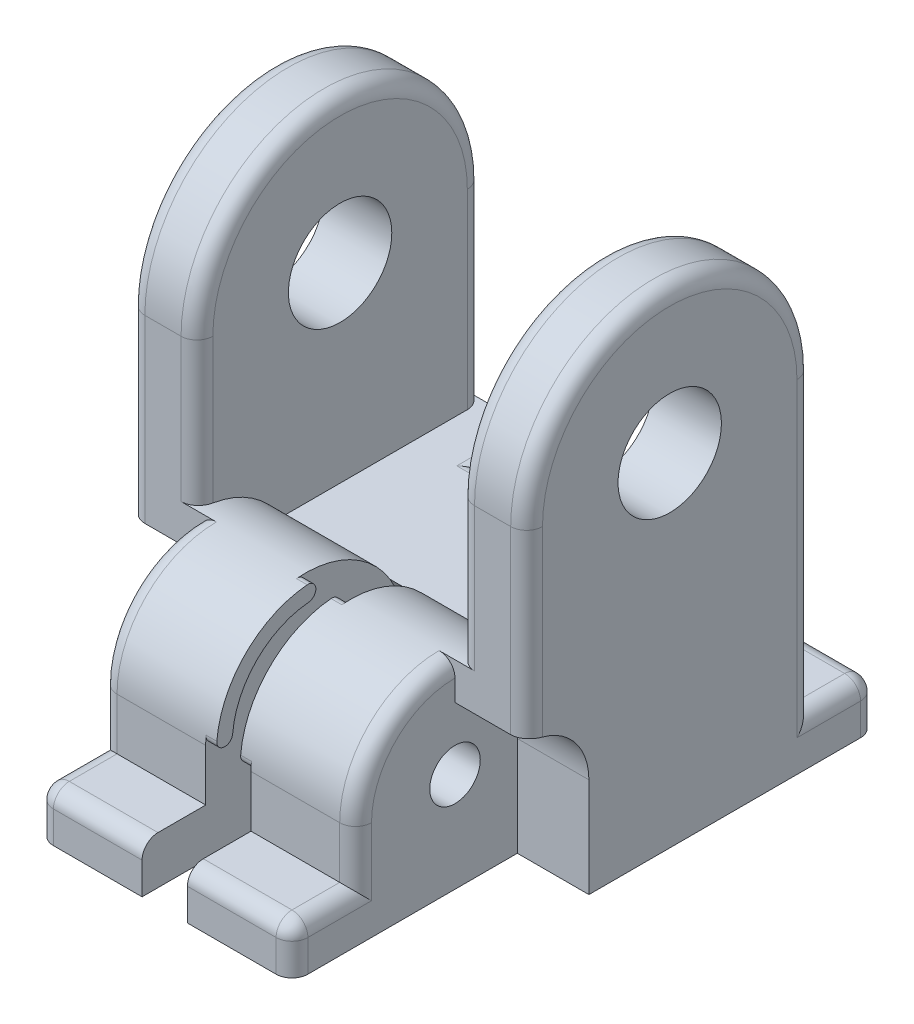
ISO-10303-21;
HEADER;
FILE_DESCRIPTION(('STEP AP214'),'2;1');
FILE_NAME('part.step','',(''),(''),'','','');
FILE_SCHEMA(('AUTOMOTIVE_DESIGN { 1 0 10303 214 1 1 1 1 }'));
ENDSEC;
DATA;
#1=APPLICATION_CONTEXT('core data for automotive mechanical design processes');
#2=APPLICATION_PROTOCOL_DEFINITION('international standard','automotive_design',2000,#1);
#3=PRODUCT_CONTEXT('',#1,'mechanical');
#4=PRODUCT('Part','Part','',(#3));
#5=PRODUCT_RELATED_PRODUCT_CATEGORY('part','',(#4));
#6=PRODUCT_DEFINITION_FORMATION('','',#4);
#7=PRODUCT_DEFINITION_CONTEXT('part definition',#1,'design');
#8=PRODUCT_DEFINITION('design','',#6,#7);
#9=PRODUCT_DEFINITION_SHAPE('','',#8);
#10=(LENGTH_UNIT() NAMED_UNIT(*) SI_UNIT(.MILLI.,.METRE.));
#11=(NAMED_UNIT(*) PLANE_ANGLE_UNIT() SI_UNIT($,.RADIAN.));
#12=(NAMED_UNIT(*) SI_UNIT($,.STERADIAN.) SOLID_ANGLE_UNIT());
#13=UNCERTAINTY_MEASURE_WITH_UNIT(LENGTH_MEASURE(1.E-05),#10,'distance_accuracy_value','');
#14=(GEOMETRIC_REPRESENTATION_CONTEXT(3) GLOBAL_UNCERTAINTY_ASSIGNED_CONTEXT((#13)) GLOBAL_UNIT_ASSIGNED_CONTEXT((#10,
#11,#12)) REPRESENTATION_CONTEXT('',''));
#15=CARTESIAN_POINT('',(0.,0.,0.));
#16=DIRECTION('',(0.,0.,1.));
#17=DIRECTION('',(1.,0.,0.));
#18=AXIS2_PLACEMENT_3D('',#15,#16,#17);
#19=CARTESIAN_POINT('',(12.5,6.25,0.));
#20=DIRECTION('',(-1.,0.,0.));
#21=DIRECTION('',(0.,0.,1.));
#22=AXIS2_PLACEMENT_3D('',#19,#20,#21);
#23=CYLINDRICAL_SURFACE('',#22,1.5875);
#24=CARTESIAN_POINT('',(-8.,6.25,0.));
#25=DIRECTION('',(1.,0.,0.));
#26=DIRECTION('',(0.,0.,-1.));
#27=AXIS2_PLACEMENT_3D('',#24,#25,#26);
#28=CIRCLE('',#27,1.5875);
#29=CARTESIAN_POINT('',(-8.,6.25,-1.5875));
#30=VERTEX_POINT('',#29);
#31=EDGE_CURVE('E493',#30,#30,#28,.T.);
#32=ORIENTED_EDGE('',*,*,#31,.F.);
#33=EDGE_LOOP('',(#32));
#34=FACE_BOUND('',#33,.T.);
#35=CARTESIAN_POINT('',(-1.425,6.25,0.));
#36=DIRECTION('',(1.,0.,0.));
#37=DIRECTION('',(0.,0.,-1.));
#38=AXIS2_PLACEMENT_3D('',#35,#36,#37);
#39=CIRCLE('',#38,1.5875);
#40=CARTESIAN_POINT('',(-1.425,6.25,-1.5875));
#41=VERTEX_POINT('',#40);
#42=EDGE_CURVE('E1199',#41,#41,#39,.T.);
#43=ORIENTED_EDGE('',*,*,#42,.T.);
#44=EDGE_LOOP('',(#43));
#45=FACE_BOUND('',#44,.T.);
#46=ADVANCED_FACE('F32',(#34,#45),#23,.F.);
#47=CARTESIAN_POINT('',(12.5,3.,6.25));
#48=DIRECTION('',(0.,0.,-1.));
#49=DIRECTION('',(0.,1.,0.));
#50=AXIS2_PLACEMENT_3D('',#47,#48,#49);
#51=PLANE('',#50);
#52=DIRECTION('',(-1.,0.,0.));
#53=VECTOR('',#52,1.);
#54=CARTESIAN_POINT('',(12.5,6.25,6.25));
#55=LINE('',#54,#53);
#56=CARTESIAN_POINT('',(-1.425,6.25,6.25));
#57=VERTEX_POINT('',#56);
#58=CARTESIAN_POINT('',(-7.,6.25,6.25));
#59=VERTEX_POINT('',#58);
#60=EDGE_CURVE('E487',#57,#59,#55,.T.);
#61=ORIENTED_EDGE('',*,*,#60,.T.);
#62=DIRECTION('',(0.,1.,0.));
#63=VECTOR('',#62,1.);
#64=CARTESIAN_POINT('',(-7.,3.,6.25));
#65=LINE('',#64,#63);
#66=CARTESIAN_POINT('',(-7.,3.,6.25));
#67=VERTEX_POINT('',#66);
#68=EDGE_CURVE('E626',#59,#67,#65,.F.);
#69=ORIENTED_EDGE('',*,*,#68,.T.);
#70=DIRECTION('',(-1.,0.,0.));
#71=VECTOR('',#70,1.);
#72=CARTESIAN_POINT('',(12.5,3.,6.25));
#73=LINE('',#72,#71);
#74=CARTESIAN_POINT('',(-1.425,3.,6.25));
#75=VERTEX_POINT('',#74);
#76=EDGE_CURVE('E479',#75,#67,#73,.T.);
#77=ORIENTED_EDGE('',*,*,#76,.F.);
#78=DIRECTION('',(0.,-1.,0.));
#79=VECTOR('',#78,1.);
#80=CARTESIAN_POINT('',(-1.425,6.25,6.25));
#81=LINE('',#80,#79);
#82=EDGE_CURVE('E1194',#57,#75,#81,.T.);
#83=ORIENTED_EDGE('',*,*,#82,.F.);
#84=EDGE_LOOP('',(#61,#69,#77,#83));
#85=FACE_BOUND('',#84,.T.);
#86=ADVANCED_FACE('F779',(#85),#51,.F.);
#87=CARTESIAN_POINT('',(12.5,3.,10.25));
#88=DIRECTION('',(0.,-1.,0.));
#89=DIRECTION('',(0.,0.,-1.));
#90=AXIS2_PLACEMENT_3D('',#87,#88,#89);
#91=PLANE('',#90);
#92=DIRECTION('',(0.,0.,-1.));
#93=VECTOR('',#92,1.);
#94=CARTESIAN_POINT('',(-7.,3.,10.25));
#95=LINE('',#94,#93);
#96=CARTESIAN_POINT('',(-7.,3.,9.25));
#97=VERTEX_POINT('',#96);
#98=EDGE_CURVE('E613',#67,#97,#95,.F.);
#99=ORIENTED_EDGE('',*,*,#98,.T.);
#100=DIRECTION('',(-1.,0.,0.));
#101=VECTOR('',#100,1.);
#102=CARTESIAN_POINT('',(12.5,3.,9.25));
#103=LINE('',#102,#101);
#104=CARTESIAN_POINT('',(-1.425,3.,9.25));
#105=VERTEX_POINT('',#104);
#106=EDGE_CURVE('E615',#97,#105,#103,.F.);
#107=ORIENTED_EDGE('',*,*,#106,.T.);
#108=DIRECTION('',(0.,0.,1.));
#109=VECTOR('',#108,1.);
#110=CARTESIAN_POINT('',(-1.425,3.,6.25));
#111=LINE('',#110,#109);
#112=EDGE_CURVE('E1196',#75,#105,#111,.T.);
#113=ORIENTED_EDGE('',*,*,#112,.F.);
#114=ORIENTED_EDGE('',*,*,#76,.T.);
#115=EDGE_LOOP('',(#99,#107,#113,#114));
#116=FACE_BOUND('',#115,.T.);
#117=ADVANCED_FACE('F786',(#116),#91,.F.);
#118=CARTESIAN_POINT('',(12.5,0.,10.25));
#119=DIRECTION('',(0.,0.,-1.));
#120=DIRECTION('',(-1.,0.,0.));
#121=AXIS2_PLACEMENT_3D('',#118,#119,#120);
#122=PLANE('',#121);
#123=DIRECTION('',(0.,-1.,0.));
#124=VECTOR('',#123,1.);
#125=CARTESIAN_POINT('',(-1.425,3.,10.25));
#126=LINE('',#125,#124);
#127=CARTESIAN_POINT('',(-1.425,2.,10.25));
#128=VERTEX_POINT('',#127);
#129=CARTESIAN_POINT('',(-1.425,0.,10.25));
#130=VERTEX_POINT('',#129);
#131=EDGE_CURVE('E448',#128,#130,#126,.T.);
#132=ORIENTED_EDGE('',*,*,#131,.F.);
#133=DIRECTION('',(-1.,0.,0.));
#134=VECTOR('',#133,1.);
#135=CARTESIAN_POINT('',(12.5,2.,10.25));
#136=LINE('',#135,#134);
#137=CARTESIAN_POINT('',(-7.,2.,10.25));
#138=VERTEX_POINT('',#137);
#139=EDGE_CURVE('E611',#128,#138,#136,.T.);
#140=ORIENTED_EDGE('',*,*,#139,.T.);
#141=DIRECTION('',(0.,1.,0.));
#142=VECTOR('',#141,1.);
#143=CARTESIAN_POINT('',(-7.,0.,10.25));
#144=LINE('',#143,#142);
#145=CARTESIAN_POINT('',(-7.,0.,10.25));
#146=VERTEX_POINT('',#145);
#147=EDGE_CURVE('E475',#138,#146,#144,.F.);
#148=ORIENTED_EDGE('',*,*,#147,.T.);
#149=DIRECTION('',(-1.,0.,0.));
#150=VECTOR('',#149,1.);
#151=CARTESIAN_POINT('',(12.5,0.,10.25));
#152=LINE('',#151,#150);
#153=EDGE_CURVE('E466',#130,#146,#152,.T.);
#154=ORIENTED_EDGE('',*,*,#153,.F.);
#155=EDGE_LOOP('',(#132,#140,#148,#154));
#156=FACE_BOUND('',#155,.T.);
#157=ADVANCED_FACE('F473',(#156),#122,.F.);
#158=CARTESIAN_POINT('',(12.5,21.5,-9.));
#159=DIRECTION('',(-1.,0.,0.));
#160=DIRECTION('',(0.,0.,1.));
#161=AXIS2_PLACEMENT_3D('',#158,#159,#160);
#162=CYLINDRICAL_SURFACE('',#161,9.);
#163=DIRECTION('',(-1.,0.,0.));
#164=VECTOR('',#163,1.);
#165=CARTESIAN_POINT('',(12.5,21.5,0.));
#166=LINE('',#165,#164);
#167=CARTESIAN_POINT('',(-9.225,21.5,0.));
#168=VERTEX_POINT('',#167);
#169=CARTESIAN_POINT('',(-11.5,21.5,0.));
#170=VERTEX_POINT('',#169);
#171=EDGE_CURVE('E950',#168,#170,#166,.T.);
#172=ORIENTED_EDGE('',*,*,#171,.F.);
#173=CARTESIAN_POINT('',(-9.225,21.5,-9.));
#174=DIRECTION('',(1.,0.,0.));
#175=DIRECTION('',(0.,0.,-1.));
#176=AXIS2_PLACEMENT_3D('',#173,#174,#175);
#177=CIRCLE('',#176,9.);
#178=CARTESIAN_POINT('',(-9.225,21.5,-18.));
#179=VERTEX_POINT('',#178);
#180=EDGE_CURVE('E643',#168,#179,#177,.F.);
#181=ORIENTED_EDGE('',*,*,#180,.T.);
#182=DIRECTION('',(-1.,0.,0.));
#183=VECTOR('',#182,1.);
#184=CARTESIAN_POINT('',(12.5,21.5,-18.));
#185=LINE('',#184,#183);
#186=CARTESIAN_POINT('',(-11.5,21.5,-18.));
#187=VERTEX_POINT('',#186);
#188=EDGE_CURVE('E1012',#179,#187,#185,.T.);
#189=ORIENTED_EDGE('',*,*,#188,.T.);
#190=CARTESIAN_POINT('',(-11.5,21.5,-9.));
#191=DIRECTION('',(-1.,0.,0.));
#192=DIRECTION('',(0.,0.,1.));
#193=AXIS2_PLACEMENT_3D('',#190,#191,#192);
#194=CIRCLE('',#193,9.);
#195=EDGE_CURVE('E641',#187,#170,#194,.F.);
#196=ORIENTED_EDGE('',*,*,#195,.T.);
#197=EDGE_LOOP('',(#172,#181,#189,#196));
#198=FACE_BOUND('',#197,.T.);
#199=ADVANCED_FACE('F1377',(#198),#162,.T.);
#200=CARTESIAN_POINT('',(12.5,21.5,-9.));
#201=DIRECTION('',(-1.,0.,0.));
#202=DIRECTION('',(0.,0.,1.));
#203=AXIS2_PLACEMENT_3D('',#200,#201,#202);
#204=CYLINDRICAL_SURFACE('',#203,3.25000000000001);
#205=CARTESIAN_POINT('',(-12.5,21.5,-9.));
#206=DIRECTION('',(1.,0.,0.));
#207=DIRECTION('',(0.,0.,-1.));
#208=AXIS2_PLACEMENT_3D('',#205,#206,#207);
#209=CIRCLE('',#208,3.25000000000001);
#210=CARTESIAN_POINT('',(-12.5,21.5,-12.25));
#211=VERTEX_POINT('',#210);
#212=EDGE_CURVE('E996',#211,#211,#209,.T.);
#213=ORIENTED_EDGE('',*,*,#212,.F.);
#214=EDGE_LOOP('',(#213));
#215=FACE_BOUND('',#214,.T.);
#216=CARTESIAN_POINT('',(-8.225,21.5,-9.));
#217=DIRECTION('',(1.,0.,0.));
#218=DIRECTION('',(0.,0.,-1.));
#219=AXIS2_PLACEMENT_3D('',#216,#217,#218);
#220=CIRCLE('',#219,3.25000000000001);
#221=CARTESIAN_POINT('',(-8.225,21.5,-12.25));
#222=VERTEX_POINT('',#221);
#223=EDGE_CURVE('E500',#222,#222,#220,.T.);
#224=ORIENTED_EDGE('',*,*,#223,.T.);
#225=EDGE_LOOP('',(#224));
#226=FACE_BOUND('',#225,.T.);
#227=ADVANCED_FACE('F1396',(#215,#226),#204,.F.);
#228=CARTESIAN_POINT('',(12.5,21.5,-18.));
#229=DIRECTION('',(0.,0.,1.));
#230=DIRECTION('',(0.,-1.,0.));
#231=AXIS2_PLACEMENT_3D('',#228,#229,#230);
#232=PLANE('',#231);
#233=ORIENTED_EDGE('',*,*,#188,.F.);
#234=DIRECTION('',(0.,1.,0.));
#235=VECTOR('',#234,1.);
#236=CARTESIAN_POINT('',(-9.225,9.5,-18.));
#237=LINE('',#236,#235);
#238=CARTESIAN_POINT('',(-9.225,9.5,-18.));
#239=VERTEX_POINT('',#238);
#240=EDGE_CURVE('E658',#179,#239,#237,.F.);
#241=ORIENTED_EDGE('',*,*,#240,.T.);
#242=DIRECTION('',(1.,0.,0.));
#243=VECTOR('',#242,1.);
#244=CARTESIAN_POINT('',(-8.,9.5,-18.));
#245=LINE('',#244,#243);
#246=CARTESIAN_POINT('',(-5.5,9.5,-18.));
#247=VERTEX_POINT('',#246);
#248=EDGE_CURVE('E986',#239,#247,#245,.T.);
#249=ORIENTED_EDGE('',*,*,#248,.T.);
#250=DIRECTION('',(0.,1.,0.));
#251=VECTOR('',#250,1.);
#252=CARTESIAN_POINT('',(-5.5,6.,-18.));
#253=LINE('',#252,#251);
#254=CARTESIAN_POINT('',(-5.5,5.11251780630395,-18.));
#255=VERTEX_POINT('',#254);
#256=EDGE_CURVE('E653',#247,#255,#253,.F.);
#257=ORIENTED_EDGE('',*,*,#256,.T.);
#258=DIRECTION('',(1.,0.,0.));
#259=VECTOR('',#258,1.);
#260=CARTESIAN_POINT('',(-3.,5.11251780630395,-18.));
#261=LINE('',#260,#259);
#262=CARTESIAN_POINT('',(-2.,5.11251780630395,-18.));
#263=VERTEX_POINT('',#262);
#264=EDGE_CURVE('E649',#255,#263,#261,.T.);
#265=ORIENTED_EDGE('',*,*,#264,.T.);
#266=DIRECTION('',(0.,-1.,0.));
#267=VECTOR('',#266,1.);
#268=CARTESIAN_POINT('',(-2.,9.5,-18.));
#269=LINE('',#268,#267);
#270=CARTESIAN_POINT('',(-2.,9.5,-18.));
#271=VERTEX_POINT('',#270);
#272=EDGE_CURVE('E651',#263,#271,#269,.F.);
#273=ORIENTED_EDGE('',*,*,#272,.T.);
#274=CARTESIAN_POINT('',(9.225,9.5,-18.));
#275=VERTEX_POINT('',#274);
#276=EDGE_CURVE('E989',#271,#275,#245,.T.);
#277=ORIENTED_EDGE('',*,*,#276,.T.);
#278=DIRECTION('',(0.,1.,0.));
#279=VECTOR('',#278,1.);
#280=CARTESIAN_POINT('',(9.225,21.5,-18.));
#281=LINE('',#280,#279);
#282=CARTESIAN_POINT('',(9.225,21.5,-18.));
#283=VERTEX_POINT('',#282);
#284=EDGE_CURVE('E656',#275,#283,#281,.T.);
#285=ORIENTED_EDGE('',*,*,#284,.T.);
#286=CARTESIAN_POINT('',(11.5,21.5,-18.));
#287=VERTEX_POINT('',#286);
#288=EDGE_CURVE('E1013',#287,#283,#185,.T.);
#289=ORIENTED_EDGE('',*,*,#288,.F.);
#290=DIRECTION('',(0.,1.,0.));
#291=VECTOR('',#290,1.);
#292=CARTESIAN_POINT('',(11.5,21.5,-18.));
#293=LINE('',#292,#291);
#294=CARTESIAN_POINT('',(11.5,3.,-18.));
#295=VERTEX_POINT('',#294);
#296=EDGE_CURVE('E647',#287,#295,#293,.F.);
#297=ORIENTED_EDGE('',*,*,#296,.T.);
#298=DIRECTION('',(-1.,0.,0.));
#299=VECTOR('',#298,1.);
#300=CARTESIAN_POINT('',(12.5,3.,-18.));
#301=LINE('',#300,#299);
#302=CARTESIAN_POINT('',(-11.5,3.,-18.));
#303=VERTEX_POINT('',#302);
#304=EDGE_CURVE('E481',#295,#303,#301,.T.);
#305=ORIENTED_EDGE('',*,*,#304,.T.);
#306=DIRECTION('',(0.,1.,0.));
#307=VECTOR('',#306,1.);
#308=CARTESIAN_POINT('',(-11.5,21.5,-18.));
#309=LINE('',#308,#307);
#310=EDGE_CURVE('E645',#303,#187,#309,.T.);
#311=ORIENTED_EDGE('',*,*,#310,.T.);
#312=EDGE_LOOP('',(#233,#241,#249,#257,#265,#273,#277,#285,#289,#297,#305,#311));
#313=FACE_BOUND('',#312,.T.);
#314=ADVANCED_FACE('F1019',(#313),#232,.F.);
#315=CARTESIAN_POINT('',(-8.,9.5,-5.33853912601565));
#316=DIRECTION('',(0.,-1.,0.));
#317=DIRECTION('',(0.,0.,-1.));
#318=AXIS2_PLACEMENT_3D('',#315,#316,#317);
#319=PLANE('',#318);
#320=DIRECTION('',(1.,0.,0.));
#321=VECTOR('',#320,1.);
#322=CARTESIAN_POINT('',(-4.5,9.5,-13.612517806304));
#323=LINE('',#322,#321);
#324=CARTESIAN_POINT('',(-2.,9.5,-13.612517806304));
#325=VERTEX_POINT('',#324);
#326=CARTESIAN_POINT('',(-5.5,9.5,-13.612517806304));
#327=VERTEX_POINT('',#326);
#328=EDGE_CURVE('E681',#325,#327,#323,.F.);
#329=ORIENTED_EDGE('',*,*,#328,.T.);
#330=DIRECTION('',(0.,0.,1.));
#331=VECTOR('',#330,1.);
#332=CARTESIAN_POINT('',(-5.5,9.5,-18.));
#333=LINE('',#332,#331);
#334=EDGE_CURVE('E685',#327,#247,#333,.F.);
#335=ORIENTED_EDGE('',*,*,#334,.T.);
#336=ORIENTED_EDGE('',*,*,#248,.F.);
#337=CARTESIAN_POINT('',(-9.225,9.5,-17.));
#338=DIRECTION('',(0.,-1.,0.));
#339=DIRECTION('',(0.,0.,-1.));
#340=AXIS2_PLACEMENT_3D('',#337,#338,#339);
#341=CIRCLE('',#340,1.);
#342=CARTESIAN_POINT('',(-8.225,9.5,-17.));
#343=VERTEX_POINT('',#342);
#344=EDGE_CURVE('E1063',#239,#343,#341,.T.);
#345=ORIENTED_EDGE('',*,*,#344,.T.);
#346=DIRECTION('',(0.,0.,-1.));
#347=VECTOR('',#346,1.);
#348=CARTESIAN_POINT('',(-8.225,9.5,-5.33853912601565));
#349=LINE('',#348,#347);
#350=CARTESIAN_POINT('',(-8.225,9.5,-5.33853912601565));
#351=VERTEX_POINT('',#350);
#352=EDGE_CURVE('E1231',#351,#343,#349,.T.);
#353=ORIENTED_EDGE('',*,*,#352,.F.);
#354=DIRECTION('',(1.,0.,0.));
#355=VECTOR('',#354,1.);
#356=CARTESIAN_POINT('',(-8.,9.5,-5.33853912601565));
#357=LINE('',#356,#355);
#358=CARTESIAN_POINT('',(-1.425,9.5,-5.33853912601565));
#359=VERTEX_POINT('',#358);
#360=EDGE_CURVE('E990',#351,#359,#357,.T.);
#361=ORIENTED_EDGE('',*,*,#360,.T.);
#362=CARTESIAN_POINT('',(1.425,9.5,-5.33853912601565));
#363=VERTEX_POINT('',#362);
#364=EDGE_CURVE('E993',#359,#363,#357,.T.);
#365=ORIENTED_EDGE('',*,*,#364,.T.);
#366=CARTESIAN_POINT('',(8.225,9.5,-5.33853912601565));
#367=VERTEX_POINT('',#366);
#368=EDGE_CURVE('E829',#363,#367,#357,.T.);
#369=ORIENTED_EDGE('',*,*,#368,.T.);
#370=DIRECTION('',(0.,0.,-1.));
#371=VECTOR('',#370,1.);
#372=CARTESIAN_POINT('',(8.225,9.5,-5.33853912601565));
#373=LINE('',#372,#371);
#374=CARTESIAN_POINT('',(8.225,9.5,-17.));
#375=VERTEX_POINT('',#374);
#376=EDGE_CURVE('E1232',#367,#375,#373,.T.);
#377=ORIENTED_EDGE('',*,*,#376,.T.);
#378=CARTESIAN_POINT('',(9.225,9.5,-17.));
#379=DIRECTION('',(0.,-1.,0.));
#380=DIRECTION('',(0.,0.,-1.));
#381=AXIS2_PLACEMENT_3D('',#378,#379,#380);
#382=CIRCLE('',#381,1.);
#383=EDGE_CURVE('E1098',#375,#275,#382,.T.);
#384=ORIENTED_EDGE('',*,*,#383,.T.);
#385=ORIENTED_EDGE('',*,*,#276,.F.);
#386=DIRECTION('',(0.,0.,-1.));
#387=VECTOR('',#386,1.);
#388=CARTESIAN_POINT('',(-2.,9.5,-14.5));
#389=LINE('',#388,#387);
#390=EDGE_CURVE('E683',#271,#325,#389,.F.);
#391=ORIENTED_EDGE('',*,*,#390,.T.);
#392=EDGE_LOOP('',(#329,#335,#336,#345,#353,#361,#365,#369,#377,#384,#385,#391));
#393=FACE_BOUND('',#392,.T.);
#394=ADVANCED_FACE('F1241',(#393),#319,.F.);
#395=CARTESIAN_POINT('',(12.5,6.25,0.));
#396=DIRECTION('',(-1.,0.,0.));
#397=DIRECTION('',(0.,0.,1.));
#398=AXIS2_PLACEMENT_3D('',#395,#396,#397);
#399=CYLINDRICAL_SURFACE('',#398,6.25);
#400=CARTESIAN_POINT('',(7.,6.25,6.25));
#401=VERTEX_POINT('',#400);
#402=CARTESIAN_POINT('',(1.425,6.25,6.25));
#403=VERTEX_POINT('',#402);
#404=EDGE_CURVE('E488',#401,#403,#55,.T.);
#405=ORIENTED_EDGE('',*,*,#404,.F.);
#406=CARTESIAN_POINT('',(7.,6.25,0.));
#407=DIRECTION('',(1.,0.,0.));
#408=DIRECTION('',(0.,0.,-1.));
#409=AXIS2_PLACEMENT_3D('',#406,#407,#408);
#410=CIRCLE('',#409,6.25);
#411=CARTESIAN_POINT('',(7.,12.5,0.));
#412=VERTEX_POINT('',#411);
#413=EDGE_CURVE('E565',#401,#412,#410,.F.);
#414=ORIENTED_EDGE('',*,*,#413,.T.);
#415=DIRECTION('',(1.,0.,0.));
#416=VECTOR('',#415,1.);
#417=CARTESIAN_POINT('',(-8.225,12.5,0.));
#418=LINE('',#417,#416);
#419=CARTESIAN_POINT('',(9.225,12.5,0.));
#420=VERTEX_POINT('',#419);
#421=EDGE_CURVE('E1235',#412,#420,#418,.T.);
#422=ORIENTED_EDGE('',*,*,#421,.T.);
#423=CARTESIAN_POINT('',(9.225,12.5,0.));
#424=CARTESIAN_POINT('',(9.19687237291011,12.4999989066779,-1.88012767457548E-07));
#425=CARTESIAN_POINT('',(9.16875821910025,12.500000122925,-0.00118748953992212));
#426=CARTESIAN_POINT('',(9.1127309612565,12.4999978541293,-0.0059241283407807));
#427=CARTESIAN_POINT('',(9.08481784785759,12.4999943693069,-0.00947335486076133));
#428=CARTESIAN_POINT('',(9.0017262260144,12.4999629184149,-0.0236306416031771));
#429=CARTESIAN_POINT('',(8.94710405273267,12.4999140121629,-0.0377483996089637));
#430=CARTESIAN_POINT('',(8.84100553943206,12.4995779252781,-0.0749516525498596));
#431=CARTESIAN_POINT('',(8.78953076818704,12.4992906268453,-0.0980415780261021));
#432=CARTESIAN_POINT('',(8.69119195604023,12.4981976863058,-0.152529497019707));
#433=CARTESIAN_POINT('',(8.64432712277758,12.4973921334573,-0.18392605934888));
#434=CARTESIAN_POINT('',(8.55659317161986,12.4949312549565,-0.25408806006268));
#435=CARTESIAN_POINT('',(8.51571763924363,12.4932768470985,-0.292845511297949));
#436=CARTESIAN_POINT('',(8.441062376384,12.4887823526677,-0.376630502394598));
#437=CARTESIAN_POINT('',(8.40728327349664,12.4859421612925,-0.421658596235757));
#438=CARTESIAN_POINT('',(8.3479107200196,12.4788069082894,-0.516440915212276));
#439=CARTESIAN_POINT('',(8.32228267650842,12.4745181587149,-0.566173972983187));
#440=CARTESIAN_POINT('',(8.279708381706,12.4642997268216,-0.669062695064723));
#441=CARTESIAN_POINT('',(8.26275857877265,12.4583707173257,-0.722216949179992));
#442=CARTESIAN_POINT('',(8.2419020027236,12.4469998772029,-0.813061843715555));
#443=CARTESIAN_POINT('',(8.23555849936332,12.4420072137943,-0.850269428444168));
#444=CARTESIAN_POINT('',(8.22710758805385,12.4312873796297,-0.924999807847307));
#445=CARTESIAN_POINT('',(8.22499374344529,12.4255613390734,-0.962522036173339));
#446=CARTESIAN_POINT('',(8.225,12.4194813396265,-1.));
#447=B_SPLINE_CURVE_WITH_KNOTS('',3,(#423,#424,#425,#426,#427,#428,#429,#430,#431,#432,#433,
#434,#435,#436,#437,#438,#439,#440,#441,#442,#443,#444,#445,#446),.UNSPECIFIED.,.F.,.F.,(4,2,2,
2,2,2,2,2,2,2,2,4),(0.,0.0843310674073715,0.168658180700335,0.337041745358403,0.505508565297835,
0.67394637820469,0.84220245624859,1.01047340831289,1.17802038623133,1.34549873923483,
1.45948875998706,1.57330517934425),.UNSPECIFIED.);
#448=CARTESIAN_POINT('',(8.225,12.4194813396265,-1.));
#449=VERTEX_POINT('',#448);
#450=EDGE_CURVE('E1093',#420,#449,#447,.T.);
#451=ORIENTED_EDGE('',*,*,#450,.T.);
#452=CARTESIAN_POINT('',(8.225,6.25,0.));
#453=DIRECTION('',(-1.,0.,0.));
#454=DIRECTION('',(0.,0.,-1.));
#455=AXIS2_PLACEMENT_3D('',#452,#453,#454);
#456=CIRCLE('',#455,6.25);
#457=EDGE_CURVE('E1228',#449,#367,#456,.T.);
#458=ORIENTED_EDGE('',*,*,#457,.T.);
#459=ORIENTED_EDGE('',*,*,#368,.F.);
#460=CARTESIAN_POINT('',(1.425,6.25,0.));
#461=DIRECTION('',(1.,0.,0.));
#462=DIRECTION('',(0.,0.,-1.));
#463=AXIS2_PLACEMENT_3D('',#460,#461,#462);
#464=CIRCLE('',#463,6.25);
#465=CARTESIAN_POINT('',(1.425,12.4763256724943,0.543478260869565));
#466=VERTEX_POINT('',#465);
#467=EDGE_CURVE('E1213',#363,#466,#464,.T.);
#468=ORIENTED_EDGE('',*,*,#467,.T.);
#469=DIRECTION('',(-1.,0.,0.));
#470=VECTOR('',#469,1.);
#471=CARTESIAN_POINT('',(12.5,12.4763256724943,0.543478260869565));
#472=LINE('',#471,#470);
#473=CARTESIAN_POINT('',(0.749999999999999,12.4763256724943,0.543478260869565));
#474=VERTEX_POINT('',#473);
#475=EDGE_CURVE('E524',#466,#474,#472,.T.);
#476=ORIENTED_EDGE('',*,*,#475,.T.);
#477=CARTESIAN_POINT('',(0.749999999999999,6.25,0.));
#478=DIRECTION('',(1.,0.,0.));
#479=DIRECTION('',(0.,0.,-1.));
#480=AXIS2_PLACEMENT_3D('',#477,#478,#479);
#481=CIRCLE('',#480,6.25);
#482=CARTESIAN_POINT('',(0.75,6.79347826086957,6.22632567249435));
#483=VERTEX_POINT('',#482);
#484=EDGE_CURVE('E1165',#474,#483,#481,.T.);
#485=ORIENTED_EDGE('',*,*,#484,.T.);
#486=DIRECTION('',(-1.,0.,0.));
#487=VECTOR('',#486,1.);
#488=CARTESIAN_POINT('',(12.5,6.79347826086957,6.22632567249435));
#489=LINE('',#488,#487);
#490=CARTESIAN_POINT('',(1.425,6.79347826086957,6.22632567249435));
#491=VERTEX_POINT('',#490);
#492=EDGE_CURVE('E521',#483,#491,#489,.F.);
#493=ORIENTED_EDGE('',*,*,#492,.T.);
#494=CARTESIAN_POINT('',(1.425,6.25,0.));
#495=DIRECTION('',(1.,0.,0.));
#496=DIRECTION('',(0.,0.,-1.));
#497=AXIS2_PLACEMENT_3D('',#494,#495,#496);
#498=CIRCLE('',#497,6.25);
#499=EDGE_CURVE('E518',#491,#403,#498,.T.);
#500=ORIENTED_EDGE('',*,*,#499,.T.);
#501=EDGE_LOOP('',(#405,#414,#422,#451,#458,#459,#468,#476,#485,#493,#500));
#502=FACE_BOUND('',#501,.T.);
#503=ADVANCED_FACE('F1425',(#502),#399,.T.);
#504=CARTESIAN_POINT('',(10.0388347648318,6.25,0.));
#505=DIRECTION('',(-1.,0.,0.));
#506=DIRECTION('',(0.,0.,1.));
#507=AXIS2_PLACEMENT_3D('',#504,#505,#506);
#508=CYLINDRICAL_SURFACE('',#507,5.25);
#509=CARTESIAN_POINT('',(0.749999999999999,6.25,0.));
#510=DIRECTION('',(1.,0.,0.));
#511=DIRECTION('',(0.,0.,-1.));
#512=AXIS2_PLACEMENT_3D('',#509,#510,#511);
#513=CIRCLE('',#512,5.25);
#514=CARTESIAN_POINT('',(0.75,6.70652173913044,5.23011356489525));
#515=VERTEX_POINT('',#514);
#516=CARTESIAN_POINT('',(0.749999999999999,11.4801135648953,0.456521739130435));
#517=VERTEX_POINT('',#516);
#518=EDGE_CURVE('E1162',#515,#517,#513,.F.);
#519=ORIENTED_EDGE('',*,*,#518,.T.);
#520=DIRECTION('',(-1.,0.,0.));
#521=VECTOR('',#520,1.);
#522=CARTESIAN_POINT('',(10.0388347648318,11.4801135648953,0.456521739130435));
#523=LINE('',#522,#521);
#524=CARTESIAN_POINT('',(1.425,11.4801135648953,0.456521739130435));
#525=VERTEX_POINT('',#524);
#526=EDGE_CURVE('E515',#517,#525,#523,.F.);
#527=ORIENTED_EDGE('',*,*,#526,.T.);
#528=CARTESIAN_POINT('',(1.425,6.25,0.));
#529=DIRECTION('',(1.,0.,0.));
#530=DIRECTION('',(0.,0.,-1.));
#531=AXIS2_PLACEMENT_3D('',#528,#529,#530);
#532=CIRCLE('',#531,5.25);
#533=CARTESIAN_POINT('',(1.425,6.70652173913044,5.23011356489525));
#534=VERTEX_POINT('',#533);
#535=EDGE_CURVE('E1217',#525,#534,#532,.T.);
#536=ORIENTED_EDGE('',*,*,#535,.T.);
#537=DIRECTION('',(-1.,0.,0.));
#538=VECTOR('',#537,1.);
#539=CARTESIAN_POINT('',(10.0388347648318,6.70652173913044,5.23011356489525));
#540=LINE('',#539,#538);
#541=EDGE_CURVE('E512',#534,#515,#540,.T.);
#542=ORIENTED_EDGE('',*,*,#541,.T.);
#543=EDGE_LOOP('',(#519,#527,#536,#542));
#544=FACE_BOUND('',#543,.T.);
#545=ADVANCED_FACE('F1383',(#544),#508,.F.);
#546=CARTESIAN_POINT('',(12.5,0.,10.25));
#547=DIRECTION('',(0.,1.,0.));
#548=DIRECTION('',(0.,0.,1.));
#549=AXIS2_PLACEMENT_3D('',#546,#547,#548);
#550=PLANE('',#549);
#551=DIRECTION('',(0.,0.,1.));
#552=VECTOR('',#551,1.);
#553=CARTESIAN_POINT('',(8.,0.,0.));
#554=LINE('',#553,#552);
#555=CARTESIAN_POINT('',(8.,0.,-3.91875));
#556=VERTEX_POINT('',#555);
#557=CARTESIAN_POINT('',(8.,0.,9.25));
#558=VERTEX_POINT('',#557);
#559=EDGE_CURVE('E830',#556,#558,#554,.T.);
#560=ORIENTED_EDGE('',*,*,#559,.T.);
#561=CARTESIAN_POINT('',(7.,0.,9.25));
#562=DIRECTION('',(0.,1.,0.));
#563=DIRECTION('',(0.,0.,1.));
#564=AXIS2_PLACEMENT_3D('',#561,#562,#563);
#565=CIRCLE('',#564,1.);
#566=CARTESIAN_POINT('',(7.,0.,10.25));
#567=VERTEX_POINT('',#566);
#568=EDGE_CURVE('E606',#558,#567,#565,.F.);
#569=ORIENTED_EDGE('',*,*,#568,.T.);
#570=CARTESIAN_POINT('',(1.425,0.,10.25));
#571=VERTEX_POINT('',#570);
#572=EDGE_CURVE('E476',#567,#571,#152,.T.);
#573=ORIENTED_EDGE('',*,*,#572,.T.);
#574=DIRECTION('',(0.,0.,-1.));
#575=VECTOR('',#574,1.);
#576=CARTESIAN_POINT('',(1.425,0.,10.25));
#577=LINE('',#576,#575);
#578=CARTESIAN_POINT('',(1.425,0.,-6.25));
#579=VERTEX_POINT('',#578);
#580=EDGE_CURVE('E1208',#571,#579,#577,.T.);
#581=ORIENTED_EDGE('',*,*,#580,.T.);
#582=DIRECTION('',(1.,0.,0.));
#583=VECTOR('',#582,1.);
#584=CARTESIAN_POINT('',(-1.2,0.,-6.25));
#585=LINE('',#584,#583);
#586=CARTESIAN_POINT('',(-1.425,0.,-6.25));
#587=VERTEX_POINT('',#586);
#588=EDGE_CURVE('E469',#587,#579,#585,.T.);
#589=ORIENTED_EDGE('',*,*,#588,.F.);
#590=DIRECTION('',(0.,0.,-1.));
#591=VECTOR('',#590,1.);
#592=CARTESIAN_POINT('',(-1.425,0.,10.25));
#593=LINE('',#592,#591);
#594=EDGE_CURVE('E453',#130,#587,#593,.T.);
#595=ORIENTED_EDGE('',*,*,#594,.F.);
#596=ORIENTED_EDGE('',*,*,#153,.T.);
#597=CARTESIAN_POINT('',(-7.,0.,9.25));
#598=DIRECTION('',(0.,1.,0.));
#599=DIRECTION('',(0.,0.,1.));
#600=AXIS2_PLACEMENT_3D('',#597,#598,#599);
#601=CIRCLE('',#600,1.);
#602=CARTESIAN_POINT('',(-8.,0.,9.25));
#603=VERTEX_POINT('',#602);
#604=EDGE_CURVE('E604',#146,#603,#601,.F.);
#605=ORIENTED_EDGE('',*,*,#604,.T.);
#606=DIRECTION('',(0.,0.,1.));
#607=VECTOR('',#606,1.);
#608=CARTESIAN_POINT('',(-8.,0.,0.));
#609=LINE('',#608,#607);
#610=CARTESIAN_POINT('',(-8.,0.,-3.91875));
#611=VERTEX_POINT('',#610);
#612=EDGE_CURVE('E982',#611,#603,#609,.T.);
#613=ORIENTED_EDGE('',*,*,#612,.F.);
#614=DIRECTION('',(1.,0.,0.));
#615=VECTOR('',#614,1.);
#616=CARTESIAN_POINT('',(-25.3386090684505,0.,-3.91875));
#617=LINE('',#616,#615);
#618=CARTESIAN_POINT('',(-12.5,0.,-3.91875));
#619=VERTEX_POINT('',#618);
#620=EDGE_CURVE('E965',#619,#611,#617,.T.);
#621=ORIENTED_EDGE('',*,*,#620,.F.);
#622=DIRECTION('',(0.,0.,-1.));
#623=VECTOR('',#622,1.);
#624=CARTESIAN_POINT('',(-12.5,0.,10.25));
#625=LINE('',#624,#623);
#626=CARTESIAN_POINT('',(-12.5,0.,-21.));
#627=VERTEX_POINT('',#626);
#628=EDGE_CURVE('E1001',#619,#627,#625,.T.);
#629=ORIENTED_EDGE('',*,*,#628,.T.);
#630=CARTESIAN_POINT('',(-11.5,0.,-21.));
#631=DIRECTION('',(0.,1.,0.));
#632=DIRECTION('',(0.,0.,1.));
#633=AXIS2_PLACEMENT_3D('',#630,#631,#632);
#634=CIRCLE('',#633,1.);
#635=CARTESIAN_POINT('',(-11.5,0.,-22.));
#636=VERTEX_POINT('',#635);
#637=EDGE_CURVE('E602',#627,#636,#634,.F.);
#638=ORIENTED_EDGE('',*,*,#637,.T.);
#639=DIRECTION('',(-1.,0.,0.));
#640=VECTOR('',#639,1.);
#641=CARTESIAN_POINT('',(12.5,0.,-22.));
#642=LINE('',#641,#640);
#643=CARTESIAN_POINT('',(11.5,0.,-22.));
#644=VERTEX_POINT('',#643);
#645=EDGE_CURVE('E477',#644,#636,#642,.T.);
#646=ORIENTED_EDGE('',*,*,#645,.F.);
#647=CARTESIAN_POINT('',(11.5,0.,-21.));
#648=DIRECTION('',(0.,1.,0.));
#649=DIRECTION('',(0.,0.,1.));
#650=AXIS2_PLACEMENT_3D('',#647,#648,#649);
#651=CIRCLE('',#650,1.);
#652=CARTESIAN_POINT('',(12.5,0.,-21.));
#653=VERTEX_POINT('',#652);
#654=EDGE_CURVE('E600',#644,#653,#651,.F.);
#655=ORIENTED_EDGE('',*,*,#654,.T.);
#656=DIRECTION('',(0.,0.,-1.));
#657=VECTOR('',#656,1.);
#658=CARTESIAN_POINT('',(12.5,0.,10.25));
#659=LINE('',#658,#657);
#660=CARTESIAN_POINT('',(12.5,0.,-3.91875));
#661=VERTEX_POINT('',#660);
#662=EDGE_CURVE('E1004',#661,#653,#659,.T.);
#663=ORIENTED_EDGE('',*,*,#662,.F.);
#664=DIRECTION('',(-1.,0.,0.));
#665=VECTOR('',#664,1.);
#666=CARTESIAN_POINT('',(25.3386090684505,0.,-3.91875));
#667=LINE('',#666,#665);
#668=EDGE_CURVE('E974',#661,#556,#667,.T.);
#669=ORIENTED_EDGE('',*,*,#668,.T.);
#670=EDGE_LOOP('',(#560,#569,#573,#581,#589,#595,#596,#605,#613,#621,#629,#638,#646,#655,#663,#669));
#671=FACE_BOUND('',#670,.T.);
#672=ADVANCED_FACE('F465',(#671),#550,.F.);
#673=CARTESIAN_POINT('',(12.5,21.5,0.));
#674=DIRECTION('',(0.,0.,-1.));
#675=DIRECTION('',(0.,1.,0.));
#676=AXIS2_PLACEMENT_3D('',#673,#674,#675);
#677=PLANE('',#676);
#678=CARTESIAN_POINT('',(-9.225,12.5,0.));
#679=VERTEX_POINT('',#678);
#680=CARTESIAN_POINT('',(-7.,12.5,0.));
#681=VERTEX_POINT('',#680);
#682=EDGE_CURVE('E501',#679,#681,#418,.T.);
#683=ORIENTED_EDGE('',*,*,#682,.F.);
#684=DIRECTION('',(0.,-1.,0.));
#685=VECTOR('',#684,1.);
#686=CARTESIAN_POINT('',(-9.225,21.5,0.));
#687=LINE('',#686,#685);
#688=EDGE_CURVE('E639',#679,#168,#687,.F.);
#689=ORIENTED_EDGE('',*,*,#688,.T.);
#690=ORIENTED_EDGE('',*,*,#171,.T.);
#691=DIRECTION('',(0.,-1.,0.));
#692=VECTOR('',#691,1.);
#693=CARTESIAN_POINT('',(-11.5,10.16875,0.));
#694=LINE('',#693,#692);
#695=CARTESIAN_POINT('',(-11.5,10.16875,0.));
#696=VERTEX_POINT('',#695);
#697=EDGE_CURVE('E637',#170,#696,#694,.T.);
#698=ORIENTED_EDGE('',*,*,#697,.T.);
#699=DIRECTION('',(1.,0.,0.));
#700=VECTOR('',#699,1.);
#701=CARTESIAN_POINT('',(-25.3386090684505,10.16875,0.));
#702=LINE('',#701,#700);
#703=CARTESIAN_POINT('',(-8.,10.16875,0.));
#704=VERTEX_POINT('',#703);
#705=EDGE_CURVE('E948',#704,#696,#702,.F.);
#706=ORIENTED_EDGE('',*,*,#705,.F.);
#707=DIRECTION('',(0.,-1.,0.));
#708=VECTOR('',#707,1.);
#709=CARTESIAN_POINT('',(-8.,12.5,0.));
#710=LINE('',#709,#708);
#711=CARTESIAN_POINT('',(-8.,11.5,0.));
#712=VERTEX_POINT('',#711);
#713=EDGE_CURVE('E980',#712,#704,#710,.T.);
#714=ORIENTED_EDGE('',*,*,#713,.F.);
#715=CARTESIAN_POINT('',(-7.,11.5,0.));
#716=DIRECTION('',(0.,0.,-1.));
#717=DIRECTION('',(0.,1.,0.));
#718=AXIS2_PLACEMENT_3D('',#715,#716,#717);
#719=CIRCLE('',#718,1.);
#720=EDGE_CURVE('E1052',#712,#681,#719,.T.);
#721=ORIENTED_EDGE('',*,*,#720,.T.);
#722=EDGE_LOOP('',(#683,#689,#690,#698,#706,#714,#721));
#723=FACE_BOUND('',#722,.T.);
#724=ADVANCED_FACE('F806',(#723),#677,.F.);
#725=CARTESIAN_POINT('',(-12.5,6.25,0.));
#726=DIRECTION('',(-1.,0.,0.));
#727=DIRECTION('',(0.,0.,1.));
#728=AXIS2_PLACEMENT_3D('',#725,#726,#727);
#729=PLANE('',#728);
#730=ORIENTED_EDGE('',*,*,#212,.T.);
#731=EDGE_LOOP('',(#730));
#732=FACE_BOUND('',#731,.T.);
#733=CARTESIAN_POINT('',(-12.5,6.25,0.));
#734=DIRECTION('',(-1.,0.,0.));
#735=DIRECTION('',(0.,0.,1.));
#736=AXIS2_PLACEMENT_3D('',#733,#734,#735);
#737=CIRCLE('',#736,3.91875);
#738=CARTESIAN_POINT('',(-12.5,10.0390106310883,-1.));
#739=VERTEX_POINT('',#738);
#740=CARTESIAN_POINT('',(-12.5,6.25,-3.91875));
#741=VERTEX_POINT('',#740);
#742=EDGE_CURVE('E961',#739,#741,#737,.T.);
#743=ORIENTED_EDGE('',*,*,#742,.F.);
#744=DIRECTION('',(0.,-1.,0.));
#745=VECTOR('',#744,1.);
#746=CARTESIAN_POINT('',(-12.5,21.5,-1.));
#747=LINE('',#746,#745);
#748=CARTESIAN_POINT('',(-12.5,21.5,-1.));
#749=VERTEX_POINT('',#748);
#750=EDGE_CURVE('E942',#739,#749,#747,.F.);
#751=ORIENTED_EDGE('',*,*,#750,.T.);
#752=CARTESIAN_POINT('',(-12.5,21.5,-9.));
#753=DIRECTION('',(-1.,0.,0.));
#754=DIRECTION('',(0.,0.,1.));
#755=AXIS2_PLACEMENT_3D('',#752,#753,#754);
#756=CIRCLE('',#755,8.);
#757=CARTESIAN_POINT('',(-12.5,21.5,-17.));
#758=VERTEX_POINT('',#757);
#759=EDGE_CURVE('E938',#749,#758,#756,.T.);
#760=ORIENTED_EDGE('',*,*,#759,.T.);
#761=DIRECTION('',(0.,1.,0.));
#762=VECTOR('',#761,1.);
#763=CARTESIAN_POINT('',(-12.5,3.,-17.));
#764=LINE('',#763,#762);
#765=CARTESIAN_POINT('',(-12.5,2.,-17.));
#766=VERTEX_POINT('',#765);
#767=EDGE_CURVE('E1033',#758,#766,#764,.F.);
#768=ORIENTED_EDGE('',*,*,#767,.T.);
#769=DIRECTION('',(0.,0.,1.));
#770=VECTOR('',#769,1.);
#771=CARTESIAN_POINT('',(-12.5,2.,-22.));
#772=LINE('',#771,#770);
#773=CARTESIAN_POINT('',(-12.5,2.,-21.));
#774=VERTEX_POINT('',#773);
#775=EDGE_CURVE('E1030',#766,#774,#772,.F.);
#776=ORIENTED_EDGE('',*,*,#775,.T.);
#777=DIRECTION('',(0.,1.,0.));
#778=VECTOR('',#777,1.);
#779=CARTESIAN_POINT('',(-12.5,0.,-21.));
#780=LINE('',#779,#778);
#781=EDGE_CURVE('E1034',#774,#627,#780,.F.);
#782=ORIENTED_EDGE('',*,*,#781,.T.);
#783=ORIENTED_EDGE('',*,*,#628,.F.);
#784=DIRECTION('',(0.,-1.,0.));
#785=VECTOR('',#784,1.);
#786=CARTESIAN_POINT('',(-12.5,6.25,-3.91875));
#787=LINE('',#786,#785);
#788=EDGE_CURVE('E957',#741,#619,#787,.T.);
#789=ORIENTED_EDGE('',*,*,#788,.F.);
#790=EDGE_LOOP('',(#743,#751,#760,#768,#776,#782,#783,#789));
#791=FACE_BOUND('',#790,.T.);
#792=ADVANCED_FACE('F1350',(#732,#791),#729,.T.);
#793=CARTESIAN_POINT('',(12.5,6.25,0.));
#794=DIRECTION('',(-1.,0.,0.));
#795=DIRECTION('',(0.,0.,1.));
#796=AXIS2_PLACEMENT_3D('',#793,#794,#795);
#797=PLANE('',#796);
#798=CARTESIAN_POINT('',(12.5,21.5,-9.));
#799=DIRECTION('',(1.,0.,0.));
#800=DIRECTION('',(0.,0.,-1.));
#801=AXIS2_PLACEMENT_3D('',#798,#799,#800);
#802=CIRCLE('',#801,3.25000000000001);
#803=CARTESIAN_POINT('',(12.5,21.5,-12.25));
#804=VERTEX_POINT('',#803);
#805=EDGE_CURVE('E998',#804,#804,#802,.T.);
#806=ORIENTED_EDGE('',*,*,#805,.F.);
#807=EDGE_LOOP('',(#806));
#808=FACE_BOUND('',#807,.T.);
#809=CARTESIAN_POINT('',(12.5,21.5,-9.));
#810=DIRECTION('',(-1.,0.,0.));
#811=DIRECTION('',(0.,0.,1.));
#812=AXIS2_PLACEMENT_3D('',#809,#810,#811);
#813=CIRCLE('',#812,8.);
#814=CARTESIAN_POINT('',(12.5,21.5,-17.));
#815=VERTEX_POINT('',#814);
#816=CARTESIAN_POINT('',(12.5,21.5,-1.));
#817=VERTEX_POINT('',#816);
#818=EDGE_CURVE('E699',#815,#817,#813,.F.);
#819=ORIENTED_EDGE('',*,*,#818,.T.);
#820=DIRECTION('',(0.,-1.,0.));
#821=VECTOR('',#820,1.);
#822=CARTESIAN_POINT('',(12.5,6.25,-1.));
#823=LINE('',#822,#821);
#824=CARTESIAN_POINT('',(12.5,10.0390106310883,-1.));
#825=VERTEX_POINT('',#824);
#826=EDGE_CURVE('E701',#817,#825,#823,.T.);
#827=ORIENTED_EDGE('',*,*,#826,.T.);
#828=CARTESIAN_POINT('',(12.5,6.25,0.));
#829=DIRECTION('',(-1.,0.,0.));
#830=DIRECTION('',(0.,0.,1.));
#831=AXIS2_PLACEMENT_3D('',#828,#829,#830);
#832=CIRCLE('',#831,3.91875);
#833=CARTESIAN_POINT('',(12.5,6.25,-3.91875));
#834=VERTEX_POINT('',#833);
#835=EDGE_CURVE('E967',#825,#834,#832,.T.);
#836=ORIENTED_EDGE('',*,*,#835,.T.);
#837=DIRECTION('',(0.,-1.,0.));
#838=VECTOR('',#837,1.);
#839=CARTESIAN_POINT('',(12.5,6.25,-3.91875));
#840=LINE('',#839,#838);
#841=EDGE_CURVE('E969',#834,#661,#840,.T.);
#842=ORIENTED_EDGE('',*,*,#841,.T.);
#843=ORIENTED_EDGE('',*,*,#662,.T.);
#844=DIRECTION('',(0.,1.,0.));
#845=VECTOR('',#844,1.);
#846=CARTESIAN_POINT('',(12.5,6.25,-21.));
#847=LINE('',#846,#845);
#848=CARTESIAN_POINT('',(12.5,2.,-21.));
#849=VERTEX_POINT('',#848);
#850=EDGE_CURVE('E695',#653,#849,#847,.T.);
#851=ORIENTED_EDGE('',*,*,#850,.T.);
#852=DIRECTION('',(0.,0.,1.));
#853=VECTOR('',#852,1.);
#854=CARTESIAN_POINT('',(12.5,2.,0.));
#855=LINE('',#854,#853);
#856=CARTESIAN_POINT('',(12.5,2.,-17.));
#857=VERTEX_POINT('',#856);
#858=EDGE_CURVE('E693',#849,#857,#855,.T.);
#859=ORIENTED_EDGE('',*,*,#858,.T.);
#860=DIRECTION('',(0.,1.,0.));
#861=VECTOR('',#860,1.);
#862=CARTESIAN_POINT('',(12.5,6.25,-17.));
#863=LINE('',#862,#861);
#864=EDGE_CURVE('E697',#857,#815,#863,.T.);
#865=ORIENTED_EDGE('',*,*,#864,.T.);
#866=EDGE_LOOP('',(#819,#827,#836,#842,#843,#851,#859,#865));
#867=FACE_BOUND('',#866,.T.);
#868=ADVANCED_FACE('F803',(#808,#867),#797,.F.);
#869=CARTESIAN_POINT('',(11.5,21.5,0.));
#870=VERTEX_POINT('',#869);
#871=CARTESIAN_POINT('',(9.225,21.5,0.));
#872=VERTEX_POINT('',#871);
#873=EDGE_CURVE('E1009',#870,#872,#166,.T.);
#874=ORIENTED_EDGE('',*,*,#873,.T.);
#875=DIRECTION('',(0.,-1.,0.));
#876=VECTOR('',#875,1.);
#877=CARTESIAN_POINT('',(9.225,21.5,0.));
#878=LINE('',#877,#876);
#879=EDGE_CURVE('E663',#872,#420,#878,.T.);
#880=ORIENTED_EDGE('',*,*,#879,.T.);
#881=ORIENTED_EDGE('',*,*,#421,.F.);
#882=CARTESIAN_POINT('',(7.,11.5,0.));
#883=DIRECTION('',(0.,0.,-1.));
#884=DIRECTION('',(0.,1.,0.));
#885=AXIS2_PLACEMENT_3D('',#882,#883,#884);
#886=CIRCLE('',#885,1.);
#887=CARTESIAN_POINT('',(8.,11.5,0.));
#888=VERTEX_POINT('',#887);
#889=EDGE_CURVE('E837',#412,#888,#886,.T.);
#890=ORIENTED_EDGE('',*,*,#889,.T.);
#891=DIRECTION('',(0.,-1.,0.));
#892=VECTOR('',#891,1.);
#893=CARTESIAN_POINT('',(8.,12.5,0.));
#894=LINE('',#893,#892);
#895=CARTESIAN_POINT('',(8.,10.16875,0.));
#896=VERTEX_POINT('',#895);
#897=EDGE_CURVE('E822',#888,#896,#894,.T.);
#898=ORIENTED_EDGE('',*,*,#897,.T.);
#899=DIRECTION('',(-1.,0.,0.));
#900=VECTOR('',#899,1.);
#901=CARTESIAN_POINT('',(25.3386090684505,10.16875,0.));
#902=LINE('',#901,#900);
#903=CARTESIAN_POINT('',(11.5,10.16875,0.));
#904=VERTEX_POINT('',#903);
#905=EDGE_CURVE('E968',#904,#896,#902,.T.);
#906=ORIENTED_EDGE('',*,*,#905,.F.);
#907=DIRECTION('',(0.,-1.,0.));
#908=VECTOR('',#907,1.);
#909=CARTESIAN_POINT('',(11.5,21.5,0.));
#910=LINE('',#909,#908);
#911=EDGE_CURVE('E661',#904,#870,#910,.F.);
#912=ORIENTED_EDGE('',*,*,#911,.T.);
#913=EDGE_LOOP('',(#874,#880,#881,#890,#898,#906,#912));
#914=FACE_BOUND('',#913,.T.);
#915=ADVANCED_FACE('F795',(#914),#677,.F.);
#916=CARTESIAN_POINT('',(1.425,6.25,0.));
#917=DIRECTION('',(1.,0.,0.));
#918=DIRECTION('',(0.,0.,-1.));
#919=AXIS2_PLACEMENT_3D('',#916,#917,#918);
#920=CIRCLE('',#919,1.5875);
#921=CARTESIAN_POINT('',(1.425,6.25,-1.5875));
#922=VERTEX_POINT('',#921);
#923=EDGE_CURVE('E810',#922,#922,#920,.T.);
#924=ORIENTED_EDGE('',*,*,#923,.F.);
#925=EDGE_LOOP('',(#924));
#926=FACE_BOUND('',#925,.T.);
#927=CARTESIAN_POINT('',(8.,6.25,0.));
#928=DIRECTION('',(1.,0.,0.));
#929=DIRECTION('',(0.,0.,-1.));
#930=AXIS2_PLACEMENT_3D('',#927,#928,#929);
#931=CIRCLE('',#930,1.5875);
#932=CARTESIAN_POINT('',(8.,6.25,-1.5875));
#933=VERTEX_POINT('',#932);
#934=EDGE_CURVE('E490',#933,#933,#931,.T.);
#935=ORIENTED_EDGE('',*,*,#934,.T.);
#936=EDGE_LOOP('',(#935));
#937=FACE_BOUND('',#936,.T.);
#938=ADVANCED_FACE('F782',(#926,#937),#23,.F.);
#939=CARTESIAN_POINT('',(7.,3.,6.25));
#940=VERTEX_POINT('',#939);
#941=CARTESIAN_POINT('',(1.425,3.,6.25));
#942=VERTEX_POINT('',#941);
#943=EDGE_CURVE('E485',#940,#942,#73,.T.);
#944=ORIENTED_EDGE('',*,*,#943,.F.);
#945=DIRECTION('',(0.,1.,0.));
#946=VECTOR('',#945,1.);
#947=CARTESIAN_POINT('',(7.,6.25,6.25));
#948=LINE('',#947,#946);
#949=EDGE_CURVE('E590',#940,#401,#948,.T.);
#950=ORIENTED_EDGE('',*,*,#949,.T.);
#951=ORIENTED_EDGE('',*,*,#404,.T.);
#952=DIRECTION('',(0.,-1.,0.));
#953=VECTOR('',#952,1.);
#954=CARTESIAN_POINT('',(1.425,6.25,6.25));
#955=LINE('',#954,#953);
#956=EDGE_CURVE('E1220',#403,#942,#955,.T.);
#957=ORIENTED_EDGE('',*,*,#956,.T.);
#958=EDGE_LOOP('',(#944,#950,#951,#957));
#959=FACE_BOUND('',#958,.T.);
#960=ADVANCED_FACE('F789',(#959),#51,.F.);
#961=DIRECTION('',(-1.,0.,0.));
#962=VECTOR('',#961,1.);
#963=CARTESIAN_POINT('',(12.5,3.,9.25));
#964=LINE('',#963,#962);
#965=CARTESIAN_POINT('',(1.425,3.,9.25));
#966=VERTEX_POINT('',#965);
#967=CARTESIAN_POINT('',(7.,3.,9.25));
#968=VERTEX_POINT('',#967);
#969=EDGE_CURVE('E592',#966,#968,#964,.F.);
#970=ORIENTED_EDGE('',*,*,#969,.T.);
#971=DIRECTION('',(0.,0.,-1.));
#972=VECTOR('',#971,1.);
#973=CARTESIAN_POINT('',(7.,3.,6.25));
#974=LINE('',#973,#972);
#975=EDGE_CURVE('E594',#968,#940,#974,.T.);
#976=ORIENTED_EDGE('',*,*,#975,.T.);
#977=ORIENTED_EDGE('',*,*,#943,.T.);
#978=DIRECTION('',(0.,0.,1.));
#979=VECTOR('',#978,1.);
#980=CARTESIAN_POINT('',(1.425,3.,6.25));
#981=LINE('',#980,#979);
#982=EDGE_CURVE('E460',#942,#966,#981,.T.);
#983=ORIENTED_EDGE('',*,*,#982,.T.);
#984=EDGE_LOOP('',(#970,#976,#977,#983));
#985=FACE_BOUND('',#984,.T.);
#986=ADVANCED_FACE('F801',(#985),#91,.F.);
#987=ORIENTED_EDGE('',*,*,#572,.F.);
#988=DIRECTION('',(0.,1.,0.));
#989=VECTOR('',#988,1.);
#990=CARTESIAN_POINT('',(7.,3.,10.25));
#991=LINE('',#990,#989);
#992=CARTESIAN_POINT('',(7.,2.,10.25));
#993=VERTEX_POINT('',#992);
#994=EDGE_CURVE('E598',#567,#993,#991,.T.);
#995=ORIENTED_EDGE('',*,*,#994,.T.);
#996=DIRECTION('',(-1.,0.,0.));
#997=VECTOR('',#996,1.);
#998=CARTESIAN_POINT('',(12.5,2.,10.25));
#999=LINE('',#998,#997);
#1000=CARTESIAN_POINT('',(1.425,2.,10.25));
#1001=VERTEX_POINT('',#1000);
#1002=EDGE_CURVE('E596',#993,#1001,#999,.T.);
#1003=ORIENTED_EDGE('',*,*,#1002,.T.);
#1004=DIRECTION('',(0.,-1.,0.));
#1005=VECTOR('',#1004,1.);
#1006=CARTESIAN_POINT('',(1.425,3.,10.25));
#1007=LINE('',#1006,#1005);
#1008=EDGE_CURVE('E569',#1001,#571,#1007,.T.);
#1009=ORIENTED_EDGE('',*,*,#1008,.T.);
#1010=EDGE_LOOP('',(#987,#995,#1003,#1009));
#1011=FACE_BOUND('',#1010,.T.);
#1012=ADVANCED_FACE('F1278',(#1011),#122,.F.);
#1013=ORIENTED_EDGE('',*,*,#682,.T.);
#1014=CARTESIAN_POINT('',(-7.,6.25,0.));
#1015=DIRECTION('',(1.,0.,0.));
#1016=DIRECTION('',(0.,0.,-1.));
#1017=AXIS2_PLACEMENT_3D('',#1014,#1015,#1016);
#1018=CIRCLE('',#1017,6.25);
#1019=EDGE_CURVE('E628',#681,#59,#1018,.T.);
#1020=ORIENTED_EDGE('',*,*,#1019,.T.);
#1021=ORIENTED_EDGE('',*,*,#60,.F.);
#1022=CARTESIAN_POINT('',(-1.425,6.25,0.));
#1023=DIRECTION('',(1.,0.,0.));
#1024=DIRECTION('',(0.,0.,-1.));
#1025=AXIS2_PLACEMENT_3D('',#1022,#1023,#1024);
#1026=CIRCLE('',#1025,6.25);
#1027=CARTESIAN_POINT('',(-1.425,6.79347826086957,6.22632567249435));
#1028=VERTEX_POINT('',#1027);
#1029=EDGE_CURVE('E542',#57,#1028,#1026,.F.);
#1030=ORIENTED_EDGE('',*,*,#1029,.T.);
#1031=DIRECTION('',(-1.,0.,0.));
#1032=VECTOR('',#1031,1.);
#1033=CARTESIAN_POINT('',(12.5,6.79347826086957,6.22632567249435));
#1034=LINE('',#1033,#1032);
#1035=CARTESIAN_POINT('',(-0.750000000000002,6.79347826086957,6.22632567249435));
#1036=VERTEX_POINT('',#1035);
#1037=EDGE_CURVE('E540',#1028,#1036,#1034,.F.);
#1038=ORIENTED_EDGE('',*,*,#1037,.T.);
#1039=CARTESIAN_POINT('',(-0.749999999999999,6.25,0.));
#1040=DIRECTION('',(-1.,0.,0.));
#1041=DIRECTION('',(0.,0.,1.));
#1042=AXIS2_PLACEMENT_3D('',#1039,#1040,#1041);
#1043=CIRCLE('',#1042,6.25);
#1044=CARTESIAN_POINT('',(-0.749999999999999,12.4763256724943,0.543478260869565));
#1045=VERTEX_POINT('',#1044);
#1046=EDGE_CURVE('E1159',#1036,#1045,#1043,.T.);
#1047=ORIENTED_EDGE('',*,*,#1046,.T.);
#1048=DIRECTION('',(-1.,0.,0.));
#1049=VECTOR('',#1048,1.);
#1050=CARTESIAN_POINT('',(12.5,12.4763256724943,0.543478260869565));
#1051=LINE('',#1050,#1049);
#1052=CARTESIAN_POINT('',(-1.425,12.4763256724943,0.543478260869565));
#1053=VERTEX_POINT('',#1052);
#1054=EDGE_CURVE('E545',#1045,#1053,#1051,.T.);
#1055=ORIENTED_EDGE('',*,*,#1054,.T.);
#1056=CARTESIAN_POINT('',(-1.425,6.25,0.));
#1057=DIRECTION('',(1.,0.,0.));
#1058=DIRECTION('',(0.,0.,-1.));
#1059=AXIS2_PLACEMENT_3D('',#1056,#1057,#1058);
#1060=CIRCLE('',#1059,6.25);
#1061=EDGE_CURVE('E1477',#359,#1053,#1060,.T.);
#1062=ORIENTED_EDGE('',*,*,#1061,.F.);
#1063=ORIENTED_EDGE('',*,*,#360,.F.);
#1064=CARTESIAN_POINT('',(-8.225,6.25,0.));
#1065=DIRECTION('',(-1.,0.,0.));
#1066=DIRECTION('',(0.,0.,-1.));
#1067=AXIS2_PLACEMENT_3D('',#1064,#1065,#1066);
#1068=CIRCLE('',#1067,6.25);
#1069=CARTESIAN_POINT('',(-8.225,12.4194813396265,-1.));
#1070=VERTEX_POINT('',#1069);
#1071=EDGE_CURVE('E1229',#1070,#351,#1068,.T.);
#1072=ORIENTED_EDGE('',*,*,#1071,.F.);
#1073=CARTESIAN_POINT('',(-8.225,12.4194813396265,-1.));
#1074=CARTESIAN_POINT('',(-8.22500017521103,12.4239783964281,-0.972261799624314));
#1075=CARTESIAN_POINT('',(-8.22615492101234,12.4282841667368,-0.944505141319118));
#1076=CARTESIAN_POINT('',(-8.23077683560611,12.4364965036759,-0.889124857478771));
#1077=CARTESIAN_POINT('',(-8.23424408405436,12.4404030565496,-0.861501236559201));
#1078=CARTESIAN_POINT('',(-8.24810570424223,12.4514875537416,-0.779169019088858));
#1079=CARTESIAN_POINT('',(-8.26195994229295,12.4580437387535,-0.724915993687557));
#1080=CARTESIAN_POINT('',(-8.29860820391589,12.4694689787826,-0.61930410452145));
#1081=CARTESIAN_POINT('',(-8.32141011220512,12.4743365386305,-0.5679478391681));
#1082=CARTESIAN_POINT('',(-8.37534672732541,12.4825212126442,-0.469691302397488));
#1083=CARTESIAN_POINT('',(-8.40647887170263,12.485838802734,-0.422789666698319));
#1084=CARTESIAN_POINT('',(-8.47597137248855,12.4911629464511,-0.335120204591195));
#1085=CARTESIAN_POINT('',(-8.51428223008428,12.4931780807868,-0.294313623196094));
#1086=CARTESIAN_POINT('',(-8.59719881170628,12.4962519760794,-0.219628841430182));
#1087=CARTESIAN_POINT('',(-8.64180607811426,12.4973105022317,-0.185752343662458));
#1088=CARTESIAN_POINT('',(-8.73618705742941,12.4988059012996,-0.125816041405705));
#1089=CARTESIAN_POINT('',(-8.78597588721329,12.4992408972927,-0.099780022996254));
#1090=CARTESIAN_POINT('',(-8.88919748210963,12.4997832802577,-0.0564077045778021));
#1091=CARTESIAN_POINT('',(-8.94262832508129,12.4998908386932,-0.039066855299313));
#1092=CARTESIAN_POINT('',(-9.03444493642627,12.4999814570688,-0.0175732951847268));
#1093=CARTESIAN_POINT('',(-9.07227978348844,12.499993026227,-0.0109883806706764));
#1094=CARTESIAN_POINT('',(-9.14840465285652,12.5000000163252,-0.00220152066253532));
#1095=CARTESIAN_POINT('',(-9.18669401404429,12.499995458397,6.15451329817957E-06));
#1096=CARTESIAN_POINT('',(-9.225,12.5,0.));
#1097=B_SPLINE_CURVE_WITH_KNOTS('',3,(#1073,#1074,#1075,#1076,#1077,#1078,#1079,#1080,#1081,
#1082,#1083,#1084,#1085,#1086,#1087,#1088,#1089,#1090,#1091,#1092,#1093,#1094,#1095,#1096),
.UNSPECIFIED.,.F.,.F.,(4,2,2,2,2,2,2,2,2,2,2,4),(0.,0.0842515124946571,0.168505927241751,
0.33676549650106,0.505173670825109,0.673530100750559,0.840765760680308,1.00804245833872,
1.17582163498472,1.34351293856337,1.4584857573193,1.57330798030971),.UNSPECIFIED.);
#1098=EDGE_CURVE('E1055',#1070,#679,#1097,.T.);
#1099=ORIENTED_EDGE('',*,*,#1098,.T.);
#1100=EDGE_LOOP('',(#1013,#1020,#1021,#1030,#1038,#1047,#1055,#1062,#1063,#1072,#1099));
#1101=FACE_BOUND('',#1100,.T.);
#1102=ADVANCED_FACE('F1065',(#1101),#399,.T.);
#1103=CARTESIAN_POINT('',(12.5,3.,-22.));
#1104=DIRECTION('',(0.,0.,1.));
#1105=DIRECTION('',(1.,0.,0.));
#1106=AXIS2_PLACEMENT_3D('',#1103,#1104,#1105);
#1107=PLANE('',#1106);
#1108=ORIENTED_EDGE('',*,*,#645,.T.);
#1109=DIRECTION('',(0.,1.,0.));
#1110=VECTOR('',#1109,1.);
#1111=CARTESIAN_POINT('',(-11.5,3.,-22.));
#1112=LINE('',#1111,#1110);
#1113=CARTESIAN_POINT('',(-11.5,2.,-22.));
#1114=VERTEX_POINT('',#1113);
#1115=EDGE_CURVE('E1049',#636,#1114,#1112,.T.);
#1116=ORIENTED_EDGE('',*,*,#1115,.T.);
#1117=DIRECTION('',(-1.,0.,0.));
#1118=VECTOR('',#1117,1.);
#1119=CARTESIAN_POINT('',(12.5,2.,-22.));
#1120=LINE('',#1119,#1118);
#1121=CARTESIAN_POINT('',(11.5,2.,-22.));
#1122=VERTEX_POINT('',#1121);
#1123=EDGE_CURVE('E1047',#1114,#1122,#1120,.F.);
#1124=ORIENTED_EDGE('',*,*,#1123,.T.);
#1125=DIRECTION('',(0.,1.,0.));
#1126=VECTOR('',#1125,1.);
#1127=CARTESIAN_POINT('',(11.5,3.,-22.));
#1128=LINE('',#1127,#1126);
#1129=EDGE_CURVE('E1045',#1122,#644,#1128,.F.);
#1130=ORIENTED_EDGE('',*,*,#1129,.T.);
#1131=EDGE_LOOP('',(#1108,#1116,#1124,#1130));
#1132=FACE_BOUND('',#1131,.T.);
#1133=ADVANCED_FACE('F1357',(#1132),#1107,.F.);
#1134=CARTESIAN_POINT('',(12.5,3.,-18.));
#1135=DIRECTION('',(0.,-1.,0.));
#1136=DIRECTION('',(0.,0.,-1.));
#1137=AXIS2_PLACEMENT_3D('',#1134,#1135,#1136);
#1138=PLANE('',#1137);
#1139=DIRECTION('',(-1.,0.,0.));
#1140=VECTOR('',#1139,1.);
#1141=CARTESIAN_POINT('',(12.5,3.,-21.));
#1142=LINE('',#1141,#1140);
#1143=CARTESIAN_POINT('',(11.5,3.,-21.));
#1144=VERTEX_POINT('',#1143);
#1145=CARTESIAN_POINT('',(-11.5,3.,-21.));
#1146=VERTEX_POINT('',#1145);
#1147=EDGE_CURVE('E1042',#1144,#1146,#1142,.T.);
#1148=ORIENTED_EDGE('',*,*,#1147,.T.);
#1149=DIRECTION('',(0.,0.,1.));
#1150=VECTOR('',#1149,1.);
#1151=CARTESIAN_POINT('',(-11.5,3.,-18.));
#1152=LINE('',#1151,#1150);
#1153=EDGE_CURVE('E1029',#1146,#303,#1152,.T.);
#1154=ORIENTED_EDGE('',*,*,#1153,.T.);
#1155=ORIENTED_EDGE('',*,*,#304,.F.);
#1156=DIRECTION('',(0.,0.,1.));
#1157=VECTOR('',#1156,1.);
#1158=CARTESIAN_POINT('',(11.5,3.,-18.));
#1159=LINE('',#1158,#1157);
#1160=EDGE_CURVE('E1040',#295,#1144,#1159,.F.);
#1161=ORIENTED_EDGE('',*,*,#1160,.T.);
#1162=EDGE_LOOP('',(#1148,#1154,#1155,#1161));
#1163=FACE_BOUND('',#1162,.T.);
#1164=ADVANCED_FACE('F1368',(#1163),#1138,.F.);
#1165=ORIENTED_EDGE('',*,*,#288,.T.);
#1166=CARTESIAN_POINT('',(9.225,21.5,-9.));
#1167=DIRECTION('',(1.,0.,0.));
#1168=DIRECTION('',(0.,0.,-1.));
#1169=AXIS2_PLACEMENT_3D('',#1166,#1167,#1168);
#1170=CIRCLE('',#1169,9.);
#1171=EDGE_CURVE('E674',#283,#872,#1170,.T.);
#1172=ORIENTED_EDGE('',*,*,#1171,.T.);
#1173=ORIENTED_EDGE('',*,*,#873,.F.);
#1174=CARTESIAN_POINT('',(11.5,21.5,-9.));
#1175=DIRECTION('',(-1.,0.,0.));
#1176=DIRECTION('',(0.,0.,1.));
#1177=AXIS2_PLACEMENT_3D('',#1174,#1175,#1176);
#1178=CIRCLE('',#1177,9.);
#1179=EDGE_CURVE('E672',#870,#287,#1178,.T.);
#1180=ORIENTED_EDGE('',*,*,#1179,.T.);
#1181=EDGE_LOOP('',(#1165,#1172,#1173,#1180));
#1182=FACE_BOUND('',#1181,.T.);
#1183=ADVANCED_FACE('F1252',(#1182),#162,.T.);
#1184=CARTESIAN_POINT('',(8.225,21.5,-9.));
#1185=DIRECTION('',(1.,0.,0.));
#1186=DIRECTION('',(0.,0.,-1.));
#1187=AXIS2_PLACEMENT_3D('',#1184,#1185,#1186);
#1188=CIRCLE('',#1187,3.25000000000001);
#1189=CARTESIAN_POINT('',(8.225,21.5,-12.25));
#1190=VERTEX_POINT('',#1189);
#1191=EDGE_CURVE('E497',#1190,#1190,#1188,.T.);
#1192=ORIENTED_EDGE('',*,*,#1191,.F.);
#1193=EDGE_LOOP('',(#1192));
#1194=FACE_BOUND('',#1193,.T.);
#1195=ORIENTED_EDGE('',*,*,#805,.T.);
#1196=EDGE_LOOP('',(#1195));
#1197=FACE_BOUND('',#1196,.T.);
#1198=ADVANCED_FACE('F1375',(#1194,#1197),#204,.F.);
#1199=CARTESIAN_POINT('',(-1.2,6.25,0.));
#1200=DIRECTION('',(1.,0.,0.));
#1201=DIRECTION('',(0.,0.,-1.));
#1202=AXIS2_PLACEMENT_3D('',#1199,#1200,#1201);
#1203=CYLINDRICAL_SURFACE('',#1202,6.25);
#1204=DIRECTION('',(1.,0.,0.));
#1205=VECTOR('',#1204,1.);
#1206=CARTESIAN_POINT('',(-1.2,6.25,-6.25));
#1207=LINE('',#1206,#1205);
#1208=CARTESIAN_POINT('',(-1.425,6.25,-6.25));
#1209=VERTEX_POINT('',#1208);
#1210=CARTESIAN_POINT('',(1.425,6.25,-6.25));
#1211=VERTEX_POINT('',#1210);
#1212=EDGE_CURVE('E994',#1209,#1211,#1207,.T.);
#1213=ORIENTED_EDGE('',*,*,#1212,.T.);
#1214=EDGE_CURVE('E1214',#1211,#363,#464,.T.);
#1215=ORIENTED_EDGE('',*,*,#1214,.T.);
#1216=ORIENTED_EDGE('',*,*,#364,.F.);
#1217=EDGE_CURVE('E1202',#1209,#359,#1060,.T.);
#1218=ORIENTED_EDGE('',*,*,#1217,.F.);
#1219=EDGE_LOOP('',(#1213,#1215,#1216,#1218));
#1220=FACE_BOUND('',#1219,.T.);
#1221=ADVANCED_FACE('F1412',(#1220),#1203,.F.);
#1222=CARTESIAN_POINT('',(-1.2,6.25,-6.25));
#1223=DIRECTION('',(0.,0.,-1.));
#1224=DIRECTION('',(0.,1.,0.));
#1225=AXIS2_PLACEMENT_3D('',#1222,#1223,#1224);
#1226=PLANE('',#1225);
#1227=ORIENTED_EDGE('',*,*,#588,.T.);
#1228=DIRECTION('',(0.,1.,0.));
#1229=VECTOR('',#1228,1.);
#1230=CARTESIAN_POINT('',(1.425,0.,-6.25));
#1231=LINE('',#1230,#1229);
#1232=EDGE_CURVE('E1210',#579,#1211,#1231,.T.);
#1233=ORIENTED_EDGE('',*,*,#1232,.T.);
#1234=ORIENTED_EDGE('',*,*,#1212,.F.);
#1235=DIRECTION('',(0.,1.,0.));
#1236=VECTOR('',#1235,1.);
#1237=CARTESIAN_POINT('',(-1.425,0.,-6.25));
#1238=LINE('',#1237,#1236);
#1239=EDGE_CURVE('E471',#587,#1209,#1238,.T.);
#1240=ORIENTED_EDGE('',*,*,#1239,.F.);
#1241=EDGE_LOOP('',(#1227,#1233,#1234,#1240));
#1242=FACE_BOUND('',#1241,.T.);
#1243=ADVANCED_FACE('F817',(#1242),#1226,.F.);
#1244=CARTESIAN_POINT('',(8.,21.5,-9.));
#1245=DIRECTION('',(1.,0.,0.));
#1246=DIRECTION('',(0.,0.,-1.));
#1247=AXIS2_PLACEMENT_3D('',#1244,#1245,#1246);
#1248=PLANE('',#1247);
#1249=ORIENTED_EDGE('',*,*,#934,.F.);
#1250=EDGE_LOOP('',(#1249));
#1251=FACE_BOUND('',#1250,.T.);
#1252=ORIENTED_EDGE('',*,*,#897,.F.);
#1253=CARTESIAN_POINT('',(8.,6.25,0.));
#1254=DIRECTION('',(1.,0.,0.));
#1255=DIRECTION('',(0.,0.,-1.));
#1256=AXIS2_PLACEMENT_3D('',#1253,#1254,#1255);
#1257=CIRCLE('',#1256,5.25);
#1258=CARTESIAN_POINT('',(8.,6.25,5.25));
#1259=VERTEX_POINT('',#1258);
#1260=EDGE_CURVE('E588',#888,#1259,#1257,.T.);
#1261=ORIENTED_EDGE('',*,*,#1260,.T.);
#1262=DIRECTION('',(0.,1.,0.));
#1263=VECTOR('',#1262,1.);
#1264=CARTESIAN_POINT('',(8.,3.,5.25));
#1265=LINE('',#1264,#1263);
#1266=CARTESIAN_POINT('',(8.,2.,5.25));
#1267=VERTEX_POINT('',#1266);
#1268=EDGE_CURVE('E586',#1259,#1267,#1265,.F.);
#1269=ORIENTED_EDGE('',*,*,#1268,.T.);
#1270=DIRECTION('',(0.,0.,-1.));
#1271=VECTOR('',#1270,1.);
#1272=CARTESIAN_POINT('',(8.,2.,10.25));
#1273=LINE('',#1272,#1271);
#1274=CARTESIAN_POINT('',(8.,2.,9.25));
#1275=VERTEX_POINT('',#1274);
#1276=EDGE_CURVE('E584',#1267,#1275,#1273,.F.);
#1277=ORIENTED_EDGE('',*,*,#1276,.T.);
#1278=DIRECTION('',(0.,1.,0.));
#1279=VECTOR('',#1278,1.);
#1280=CARTESIAN_POINT('',(8.,0.,9.25));
#1281=LINE('',#1280,#1279);
#1282=EDGE_CURVE('E582',#1275,#558,#1281,.F.);
#1283=ORIENTED_EDGE('',*,*,#1282,.T.);
#1284=ORIENTED_EDGE('',*,*,#559,.F.);
#1285=DIRECTION('',(0.,1.,0.));
#1286=VECTOR('',#1285,1.);
#1287=CARTESIAN_POINT('',(8.,6.25,-3.91875));
#1288=LINE('',#1287,#1286);
#1289=CARTESIAN_POINT('',(8.,6.25,-3.91875));
#1290=VERTEX_POINT('',#1289);
#1291=EDGE_CURVE('E959',#556,#1290,#1288,.T.);
#1292=ORIENTED_EDGE('',*,*,#1291,.T.);
#1293=CARTESIAN_POINT('',(8.,6.25,0.));
#1294=DIRECTION('',(1.,0.,0.));
#1295=DIRECTION('',(0.,0.,-1.));
#1296=AXIS2_PLACEMENT_3D('',#1293,#1294,#1295);
#1297=CIRCLE('',#1296,3.91875);
#1298=EDGE_CURVE('E827',#1290,#896,#1297,.T.);
#1299=ORIENTED_EDGE('',*,*,#1298,.T.);
#1300=EDGE_LOOP('',(#1252,#1261,#1269,#1277,#1283,#1284,#1292,#1299));
#1301=FACE_BOUND('',#1300,.T.);
#1302=ADVANCED_FACE('F813',(#1251,#1301),#1248,.T.);
#1303=CARTESIAN_POINT('',(-8.,21.5,-9.));
#1304=DIRECTION('',(1.,0.,0.));
#1305=DIRECTION('',(0.,0.,-1.));
#1306=AXIS2_PLACEMENT_3D('',#1303,#1304,#1305);
#1307=PLANE('',#1306);
#1308=ORIENTED_EDGE('',*,*,#31,.T.);
#1309=EDGE_LOOP('',(#1308));
#1310=FACE_BOUND('',#1309,.T.);
#1311=ORIENTED_EDGE('',*,*,#612,.T.);
#1312=DIRECTION('',(0.,1.,0.));
#1313=VECTOR('',#1312,1.);
#1314=CARTESIAN_POINT('',(-8.,21.5,9.25));
#1315=LINE('',#1314,#1313);
#1316=CARTESIAN_POINT('',(-8.,2.,9.25));
#1317=VERTEX_POINT('',#1316);
#1318=EDGE_CURVE('E624',#603,#1317,#1315,.T.);
#1319=ORIENTED_EDGE('',*,*,#1318,.T.);
#1320=DIRECTION('',(0.,0.,-1.));
#1321=VECTOR('',#1320,1.);
#1322=CARTESIAN_POINT('',(-8.,2.,-9.));
#1323=LINE('',#1322,#1321);
#1324=CARTESIAN_POINT('',(-8.,2.,5.25));
#1325=VERTEX_POINT('',#1324);
#1326=EDGE_CURVE('E622',#1317,#1325,#1323,.T.);
#1327=ORIENTED_EDGE('',*,*,#1326,.T.);
#1328=DIRECTION('',(0.,1.,0.));
#1329=VECTOR('',#1328,1.);
#1330=CARTESIAN_POINT('',(-8.,21.5,5.25));
#1331=LINE('',#1330,#1329);
#1332=CARTESIAN_POINT('',(-8.,6.25,5.25));
#1333=VERTEX_POINT('',#1332);
#1334=EDGE_CURVE('E620',#1325,#1333,#1331,.T.);
#1335=ORIENTED_EDGE('',*,*,#1334,.T.);
#1336=CARTESIAN_POINT('',(-8.,6.25,0.));
#1337=DIRECTION('',(1.,0.,0.));
#1338=DIRECTION('',(0.,0.,-1.));
#1339=AXIS2_PLACEMENT_3D('',#1336,#1337,#1338);
#1340=CIRCLE('',#1339,5.25);
#1341=EDGE_CURVE('E618',#1333,#712,#1340,.F.);
#1342=ORIENTED_EDGE('',*,*,#1341,.T.);
#1343=ORIENTED_EDGE('',*,*,#713,.T.);
#1344=CARTESIAN_POINT('',(-8.,6.25,0.));
#1345=DIRECTION('',(-1.,0.,0.));
#1346=DIRECTION('',(0.,0.,1.));
#1347=AXIS2_PLACEMENT_3D('',#1344,#1345,#1346);
#1348=CIRCLE('',#1347,3.91875);
#1349=CARTESIAN_POINT('',(-8.,6.25,-3.91875));
#1350=VERTEX_POINT('',#1349);
#1351=EDGE_CURVE('E956',#704,#1350,#1348,.T.);
#1352=ORIENTED_EDGE('',*,*,#1351,.T.);
#1353=DIRECTION('',(0.,-1.,0.));
#1354=VECTOR('',#1353,1.);
#1355=CARTESIAN_POINT('',(-8.,6.25,-3.91875));
#1356=LINE('',#1355,#1354);
#1357=EDGE_CURVE('E1168',#1350,#611,#1356,.T.);
#1358=ORIENTED_EDGE('',*,*,#1357,.T.);
#1359=EDGE_LOOP('',(#1311,#1319,#1327,#1335,#1342,#1343,#1352,#1358));
#1360=FACE_BOUND('',#1359,.T.);
#1361=ADVANCED_FACE('F816',(#1310,#1360),#1307,.F.);
#1362=CARTESIAN_POINT('',(25.3386090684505,6.25,0.));
#1363=DIRECTION('',(-1.,0.,0.));
#1364=DIRECTION('',(0.,0.,1.));
#1365=AXIS2_PLACEMENT_3D('',#1362,#1363,#1364);
#1366=CYLINDRICAL_SURFACE('',#1365,3.91875);
#1367=ORIENTED_EDGE('',*,*,#835,.F.);
#1368=CARTESIAN_POINT('',(12.5,10.0390106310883,-1.));
#1369=CARTESIAN_POINT('',(12.4999998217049,10.0461695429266,-0.972880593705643));
#1370=CARTESIAN_POINT('',(12.498895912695,10.0530312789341,-0.945693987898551));
#1371=CARTESIAN_POINT('',(12.4944543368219,10.0661338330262,-0.891349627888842));
#1372=CARTESIAN_POINT('',(12.4911163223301,10.072374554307,-0.864191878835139));
#1373=CARTESIAN_POINT('',(12.4777229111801,10.0901079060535,-0.783084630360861));
#1374=CARTESIAN_POINT('',(12.4642882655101,10.1006290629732,-0.729435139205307));
#1375=CARTESIAN_POINT('',(12.4285335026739,10.1190147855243,-0.62463470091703));
#1376=CARTESIAN_POINT('',(12.4062002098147,10.1268753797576,-0.573487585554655));
#1377=CARTESIAN_POINT('',(12.3531720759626,10.1401211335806,-0.475402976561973));
#1378=CARTESIAN_POINT('',(12.3224815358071,10.1455075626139,-0.428463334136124));
#1379=CARTESIAN_POINT('',(12.2541541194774,10.1541291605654,-0.34099986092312));
#1380=CARTESIAN_POINT('',(12.2166414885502,10.1573986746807,-0.300382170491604));
#1381=CARTESIAN_POINT('',(12.1353721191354,10.162416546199,-0.225827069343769));
#1382=CARTESIAN_POINT('',(12.0916133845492,10.1641644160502,-0.191891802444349));
#1383=CARTESIAN_POINT('',(11.9987681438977,10.1666614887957,-0.131484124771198));
#1384=CARTESIAN_POINT('',(11.9496471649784,10.167403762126,-0.105064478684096));
#1385=CARTESIAN_POINT('',(11.8477052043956,10.1683419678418,-0.0607519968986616));
#1386=CARTESIAN_POINT('',(11.7948858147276,10.1685381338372,-0.0428555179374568));
#1387=CARTESIAN_POINT('',(11.701577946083,10.1687130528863,-0.0196858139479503));
#1388=CARTESIAN_POINT('',(11.6615976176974,10.1687361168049,-0.0123113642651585));
#1389=CARTESIAN_POINT('',(11.5810832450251,10.1687499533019,-0.00246673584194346));
#1390=CARTESIAN_POINT('',(11.5405498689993,10.1687407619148,8.91083415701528E-06));
#1391=CARTESIAN_POINT('',(11.5,10.16875,0.));
#1392=B_SPLINE_CURVE_WITH_KNOTS('',3,(#1368,#1369,#1370,#1371,#1372,#1373,#1374,#1375,#1376,
#1377,#1378,#1379,#1380,#1381,#1382,#1383,#1384,#1385,#1386,#1387,#1388,#1389,#1390,#1391),
.UNSPECIFIED.,.F.,.F.,(4,2,2,2,2,2,2,2,2,2,2,4),(0.,0.0840986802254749,0.168210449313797,
0.3362318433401,0.504502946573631,0.672687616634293,0.838070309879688,1.0035059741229,
1.17007595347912,1.33657466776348,1.45825314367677,1.57979572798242),.UNSPECIFIED.);
#1393=EDGE_CURVE('E704',#825,#904,#1392,.T.);
#1394=ORIENTED_EDGE('',*,*,#1393,.T.);
#1395=ORIENTED_EDGE('',*,*,#905,.T.);
#1396=ORIENTED_EDGE('',*,*,#1298,.F.);
#1397=DIRECTION('',(-1.,0.,0.));
#1398=VECTOR('',#1397,1.);
#1399=CARTESIAN_POINT('',(25.3386090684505,6.25,-3.91875));
#1400=LINE('',#1399,#1398);
#1401=EDGE_CURVE('E972',#834,#1290,#1400,.T.);
#1402=ORIENTED_EDGE('',*,*,#1401,.F.);
#1403=EDGE_LOOP('',(#1367,#1394,#1395,#1396,#1402));
#1404=FACE_BOUND('',#1403,.T.);
#1405=ADVANCED_FACE('F717',(#1404),#1366,.F.);
#1406=CARTESIAN_POINT('',(25.3386090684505,6.25,-3.91875));
#1407=DIRECTION('',(0.,0.,1.));
#1408=DIRECTION('',(1.,0.,0.));
#1409=AXIS2_PLACEMENT_3D('',#1406,#1407,#1408);
#1410=PLANE('',#1409);
#1411=ORIENTED_EDGE('',*,*,#1401,.T.);
#1412=ORIENTED_EDGE('',*,*,#1291,.F.);
#1413=ORIENTED_EDGE('',*,*,#668,.F.);
#1414=ORIENTED_EDGE('',*,*,#841,.F.);
#1415=EDGE_LOOP('',(#1411,#1412,#1413,#1414));
#1416=FACE_BOUND('',#1415,.T.);
#1417=ADVANCED_FACE('F1267',(#1416),#1410,.T.);
#1418=CARTESIAN_POINT('',(-25.3386090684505,6.25,0.));
#1419=DIRECTION('',(1.,0.,0.));
#1420=DIRECTION('',(0.,0.,-1.));
#1421=AXIS2_PLACEMENT_3D('',#1418,#1419,#1420);
#1422=CYLINDRICAL_SURFACE('',#1421,3.91875);
#1423=ORIENTED_EDGE('',*,*,#705,.T.);
#1424=CARTESIAN_POINT('',(-11.5,10.16875,0.));
#1425=CARTESIAN_POINT('',(-11.52811661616,10.1687482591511,-1.89418758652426E-07));
#1426=CARTESIAN_POINT('',(-11.5562197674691,10.1687501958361,-0.00118655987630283));
#1427=CARTESIAN_POINT('',(-11.6122253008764,10.1687465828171,-0.00591949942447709));
#1428=CARTESIAN_POINT('',(-11.640127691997,10.1687410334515,-0.0094659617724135));
#1429=CARTESIAN_POINT('',(-11.7231917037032,10.1686909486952,-0.0236129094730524));
#1430=CARTESIAN_POINT('',(-11.7777975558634,10.168613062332,-0.0377210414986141));
#1431=CARTESIAN_POINT('',(-11.8838670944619,10.1680777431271,-0.0748998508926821));
#1432=CARTESIAN_POINT('',(-11.9353291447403,10.1676201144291,-0.0979751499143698));
#1433=CARTESIAN_POINT('',(-12.0336417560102,10.1658788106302,-0.152426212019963));
#1434=CARTESIAN_POINT('',(-12.0804930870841,10.1645952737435,-0.183800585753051));
#1435=CARTESIAN_POINT('',(-12.1681155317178,10.1606765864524,-0.253836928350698));
#1436=CARTESIAN_POINT('',(-12.2089028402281,10.158045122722,-0.292478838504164));
#1437=CARTESIAN_POINT('',(-12.2833753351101,10.1508998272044,-0.375940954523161));
#1438=CARTESIAN_POINT('',(-12.3170610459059,10.1463861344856,-0.420760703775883));
#1439=CARTESIAN_POINT('',(-12.3760547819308,10.1350932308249,-0.514645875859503));
#1440=CARTESIAN_POINT('',(-12.4014517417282,10.1283397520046,-0.563658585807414));
#1441=CARTESIAN_POINT('',(-12.4437522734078,10.1122810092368,-0.664835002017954));
#1442=CARTESIAN_POINT('',(-12.4606570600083,10.1029761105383,-0.716998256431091));
#1443=CARTESIAN_POINT('',(-12.4821479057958,10.0847666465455,-0.807878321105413));
#1444=CARTESIAN_POINT('',(-12.4888642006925,10.0764903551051,-0.846234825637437));
#1445=CARTESIAN_POINT('',(-12.4977910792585,10.0586794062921,-0.923112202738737));
#1446=CARTESIAN_POINT('',(-12.5000091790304,10.0491468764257,-0.961632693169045));
#1447=CARTESIAN_POINT('',(-12.5,10.0390106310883,-1.));
#1448=B_SPLINE_CURVE_WITH_KNOTS('',3,(#1424,#1425,#1426,#1427,#1428,#1429,#1430,#1431,#1432,
#1433,#1434,#1435,#1436,#1437,#1438,#1439,#1440,#1441,#1442,#1443,#1444,#1445,#1446,#1447),
.UNSPECIFIED.,.F.,.F.,(4,2,2,2,2,2,2,2,2,2,2,4),(0.,0.0842980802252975,0.168592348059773,
0.336922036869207,0.505338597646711,0.673726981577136,0.841657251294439,1.00957511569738,
1.17562705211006,1.34165522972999,1.46082220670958,1.57978990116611),.UNSPECIFIED.);
#1449=EDGE_CURVE('E711',#696,#739,#1448,.T.);
#1450=ORIENTED_EDGE('',*,*,#1449,.T.);
#1451=ORIENTED_EDGE('',*,*,#742,.T.);
#1452=DIRECTION('',(1.,0.,0.));
#1453=VECTOR('',#1452,1.);
#1454=CARTESIAN_POINT('',(-25.3386090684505,6.25,-3.91875));
#1455=LINE('',#1454,#1453);
#1456=EDGE_CURVE('E1171',#741,#1350,#1455,.T.);
#1457=ORIENTED_EDGE('',*,*,#1456,.T.);
#1458=ORIENTED_EDGE('',*,*,#1351,.F.);
#1459=EDGE_LOOP('',(#1423,#1450,#1451,#1457,#1458));
#1460=FACE_BOUND('',#1459,.T.);
#1461=ADVANCED_FACE('F953',(#1460),#1422,.F.);
#1462=CARTESIAN_POINT('',(-25.3386090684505,6.25,-3.91875));
#1463=DIRECTION('',(0.,0.,1.));
#1464=DIRECTION('',(1.,0.,0.));
#1465=AXIS2_PLACEMENT_3D('',#1462,#1463,#1464);
#1466=PLANE('',#1465);
#1467=ORIENTED_EDGE('',*,*,#788,.T.);
#1468=ORIENTED_EDGE('',*,*,#620,.T.);
#1469=ORIENTED_EDGE('',*,*,#1357,.F.);
#1470=ORIENTED_EDGE('',*,*,#1456,.F.);
#1471=EDGE_LOOP('',(#1467,#1468,#1469,#1470));
#1472=FACE_BOUND('',#1471,.T.);
#1473=ADVANCED_FACE('F1178',(#1472),#1466,.T.);
#1474=CARTESIAN_POINT('',(-1.425,6.25,0.));
#1475=DIRECTION('',(1.,0.,0.));
#1476=DIRECTION('',(0.,0.,-1.));
#1477=AXIS2_PLACEMENT_3D('',#1474,#1475,#1476);
#1478=CIRCLE('',#1477,5.25);
#1479=CARTESIAN_POINT('',(-1.425,11.4801135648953,0.456521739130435));
#1480=VERTEX_POINT('',#1479);
#1481=CARTESIAN_POINT('',(-1.425,6.70652173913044,5.23011356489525));
#1482=VERTEX_POINT('',#1481);
#1483=EDGE_CURVE('E1197',#1480,#1482,#1478,.T.);
#1484=ORIENTED_EDGE('',*,*,#1483,.F.);
#1485=DIRECTION('',(-1.,0.,0.));
#1486=VECTOR('',#1485,1.);
#1487=CARTESIAN_POINT('',(10.0388347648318,11.4801135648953,0.456521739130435));
#1488=LINE('',#1487,#1486);
#1489=CARTESIAN_POINT('',(-0.749999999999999,11.4801135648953,0.456521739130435));
#1490=VERTEX_POINT('',#1489);
#1491=EDGE_CURVE('E529',#1480,#1490,#1488,.F.);
#1492=ORIENTED_EDGE('',*,*,#1491,.T.);
#1493=CARTESIAN_POINT('',(-0.749999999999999,6.25,0.));
#1494=DIRECTION('',(-1.,0.,0.));
#1495=DIRECTION('',(0.,0.,1.));
#1496=AXIS2_PLACEMENT_3D('',#1493,#1494,#1495);
#1497=CIRCLE('',#1496,5.25);
#1498=CARTESIAN_POINT('',(-0.750000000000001,6.70652173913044,5.23011356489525));
#1499=VERTEX_POINT('',#1498);
#1500=EDGE_CURVE('E1152',#1490,#1499,#1497,.F.);
#1501=ORIENTED_EDGE('',*,*,#1500,.T.);
#1502=DIRECTION('',(-1.,0.,0.));
#1503=VECTOR('',#1502,1.);
#1504=CARTESIAN_POINT('',(10.0388347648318,6.70652173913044,5.23011356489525));
#1505=LINE('',#1504,#1503);
#1506=EDGE_CURVE('E526',#1499,#1482,#1505,.T.);
#1507=ORIENTED_EDGE('',*,*,#1506,.T.);
#1508=EDGE_LOOP('',(#1484,#1492,#1501,#1507));
#1509=FACE_BOUND('',#1508,.T.);
#1510=ADVANCED_FACE('F1441',(#1509),#508,.F.);
#1511=CARTESIAN_POINT('',(-0.749999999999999,30.5,0.));
#1512=DIRECTION('',(-1.,0.,0.));
#1513=DIRECTION('',(0.,0.,1.));
#1514=AXIS2_PLACEMENT_3D('',#1511,#1512,#1513);
#1515=PLANE('',#1514);
#1516=ORIENTED_EDGE('',*,*,#1500,.F.);
#1517=CARTESIAN_POINT('',(-0.749999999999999,11.9782196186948,0.5));
#1518=DIRECTION('',(-1.,0.,0.));
#1519=DIRECTION('',(0.,0.,1.));
#1520=AXIS2_PLACEMENT_3D('',#1517,#1518,#1519);
#1521=CIRCLE('',#1520,0.5);
#1522=CARTESIAN_POINT('',(-0.749999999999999,11.9782196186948,0.));
#1523=VERTEX_POINT('',#1522);
#1524=EDGE_CURVE('E538',#1490,#1523,#1521,.F.);
#1525=ORIENTED_EDGE('',*,*,#1524,.T.);
#1526=CARTESIAN_POINT('',(-0.749999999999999,11.9782196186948,0.5));
#1527=DIRECTION('',(-1.,0.,0.));
#1528=DIRECTION('',(0.,0.,1.));
#1529=AXIS2_PLACEMENT_3D('',#1526,#1527,#1528);
#1530=CIRCLE('',#1529,0.5);
#1531=EDGE_CURVE('E536',#1523,#1045,#1530,.F.);
#1532=ORIENTED_EDGE('',*,*,#1531,.T.);
#1533=ORIENTED_EDGE('',*,*,#1046,.F.);
#1534=CARTESIAN_POINT('',(-0.750000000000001,6.75,5.7282196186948));
#1535=DIRECTION('',(-1.,0.,0.));
#1536=DIRECTION('',(0.,0.,1.));
#1537=AXIS2_PLACEMENT_3D('',#1534,#1535,#1536);
#1538=CIRCLE('',#1537,0.5);
#1539=CARTESIAN_POINT('',(-0.750000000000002,6.25,5.7282196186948));
#1540=VERTEX_POINT('',#1539);
#1541=EDGE_CURVE('E532',#1036,#1540,#1538,.F.);
#1542=ORIENTED_EDGE('',*,*,#1541,.T.);
#1543=CARTESIAN_POINT('',(-0.750000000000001,6.75,5.7282196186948));
#1544=DIRECTION('',(-1.,0.,0.));
#1545=DIRECTION('',(0.,0.,1.));
#1546=AXIS2_PLACEMENT_3D('',#1543,#1544,#1545);
#1547=CIRCLE('',#1546,0.5);
#1548=EDGE_CURVE('E534',#1540,#1499,#1547,.F.);
#1549=ORIENTED_EDGE('',*,*,#1548,.T.);
#1550=EDGE_LOOP('',(#1516,#1525,#1532,#1533,#1542,#1549));
#1551=FACE_BOUND('',#1550,.T.);
#1552=ADVANCED_FACE('F1444',(#1551),#1515,.F.);
#1553=CARTESIAN_POINT('',(0.749999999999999,30.5,0.));
#1554=DIRECTION('',(1.,0.,0.));
#1555=DIRECTION('',(0.,0.,-1.));
#1556=AXIS2_PLACEMENT_3D('',#1553,#1554,#1555);
#1557=PLANE('',#1556);
#1558=CARTESIAN_POINT('',(0.749999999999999,11.9782196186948,0.5));
#1559=DIRECTION('',(1.,0.,0.));
#1560=DIRECTION('',(0.,0.,-1.));
#1561=AXIS2_PLACEMENT_3D('',#1558,#1559,#1560);
#1562=CIRCLE('',#1561,0.5);
#1563=CARTESIAN_POINT('',(0.749999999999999,11.9782196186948,0.));
#1564=VERTEX_POINT('',#1563);
#1565=EDGE_CURVE('E508',#474,#1564,#1562,.F.);
#1566=ORIENTED_EDGE('',*,*,#1565,.T.);
#1567=CARTESIAN_POINT('',(0.749999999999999,11.9782196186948,0.5));
#1568=DIRECTION('',(1.,0.,0.));
#1569=DIRECTION('',(0.,0.,-1.));
#1570=AXIS2_PLACEMENT_3D('',#1567,#1568,#1569);
#1571=CIRCLE('',#1570,0.5);
#1572=EDGE_CURVE('E510',#1564,#517,#1571,.F.);
#1573=ORIENTED_EDGE('',*,*,#1572,.T.);
#1574=ORIENTED_EDGE('',*,*,#518,.F.);
#1575=CARTESIAN_POINT('',(0.750000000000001,6.75,5.7282196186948));
#1576=DIRECTION('',(1.,0.,0.));
#1577=DIRECTION('',(0.,0.,-1.));
#1578=AXIS2_PLACEMENT_3D('',#1575,#1576,#1577);
#1579=CIRCLE('',#1578,0.5);
#1580=CARTESIAN_POINT('',(0.750000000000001,6.25,5.7282196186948));
#1581=VERTEX_POINT('',#1580);
#1582=EDGE_CURVE('E506',#515,#1581,#1579,.F.);
#1583=ORIENTED_EDGE('',*,*,#1582,.T.);
#1584=CARTESIAN_POINT('',(0.750000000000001,6.75,5.7282196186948));
#1585=DIRECTION('',(1.,0.,0.));
#1586=DIRECTION('',(0.,0.,-1.));
#1587=AXIS2_PLACEMENT_3D('',#1584,#1585,#1586);
#1588=CIRCLE('',#1587,0.5);
#1589=EDGE_CURVE('E496',#1581,#483,#1588,.F.);
#1590=ORIENTED_EDGE('',*,*,#1589,.T.);
#1591=ORIENTED_EDGE('',*,*,#484,.F.);
#1592=EDGE_LOOP('',(#1566,#1573,#1574,#1583,#1590,#1591));
#1593=FACE_BOUND('',#1592,.T.);
#1594=ADVANCED_FACE('F1446',(#1593),#1557,.F.);
#1595=CARTESIAN_POINT('',(-4.5,9.5,-18.));
#1596=DIRECTION('',(1.,0.,0.));
#1597=DIRECTION('',(0.,0.,-1.));
#1598=AXIS2_PLACEMENT_3D('',#1595,#1596,#1597);
#1599=PLANE('',#1598);
#1600=CARTESIAN_POINT('',(-4.5,9.5,-18.));
#1601=DIRECTION('',(-1.,0.,0.));
#1602=DIRECTION('',(0.,0.,1.));
#1603=AXIS2_PLACEMENT_3D('',#1600,#1601,#1602);
#1604=CIRCLE('',#1603,3.5);
#1605=CARTESIAN_POINT('',(-4.5,6.14589803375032,-17.));
#1606=VERTEX_POINT('',#1605);
#1607=CARTESIAN_POINT('',(-4.5,8.5,-14.6458980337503));
#1608=VERTEX_POINT('',#1607);
#1609=EDGE_CURVE('E1133',#1606,#1608,#1604,.T.);
#1610=ORIENTED_EDGE('',*,*,#1609,.F.);
#1611=DIRECTION('',(0.,1.,0.));
#1612=VECTOR('',#1611,1.);
#1613=CARTESIAN_POINT('',(-4.5,9.5,-17.));
#1614=LINE('',#1613,#1612);
#1615=CARTESIAN_POINT('',(-4.5,8.5,-17.));
#1616=VERTEX_POINT('',#1615);
#1617=EDGE_CURVE('E678',#1606,#1616,#1614,.T.);
#1618=ORIENTED_EDGE('',*,*,#1617,.T.);
#1619=DIRECTION('',(0.,0.,1.));
#1620=VECTOR('',#1619,1.);
#1621=CARTESIAN_POINT('',(-4.5,8.5,-14.5));
#1622=LINE('',#1621,#1620);
#1623=EDGE_CURVE('E676',#1616,#1608,#1622,.T.);
#1624=ORIENTED_EDGE('',*,*,#1623,.T.);
#1625=EDGE_LOOP('',(#1610,#1618,#1624));
#1626=FACE_BOUND('',#1625,.T.);
#1627=ADVANCED_FACE('F1119',(#1626),#1599,.T.);
#1628=CARTESIAN_POINT('',(-8.,9.5,-18.));
#1629=DIRECTION('',(-1.,0.,0.));
#1630=DIRECTION('',(0.,0.,1.));
#1631=AXIS2_PLACEMENT_3D('',#1628,#1629,#1630);
#1632=CYLINDRICAL_SURFACE('',#1631,3.5);
#1633=CARTESIAN_POINT('',(-3.,6.14589803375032,-17.));
#1634=CARTESIAN_POINT('',(-3.00000676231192,6.13485726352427,-17.037006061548));
#1635=CARTESIAN_POINT('',(-2.99794453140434,6.12444881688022,-17.0741842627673));
#1636=CARTESIAN_POINT('',(-2.99171155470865,6.10984358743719,-17.1298262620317));
#1637=CARTESIAN_POINT('',(-2.98911314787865,6.10514562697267,-17.1483415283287));
#1638=CARTESIAN_POINT('',(-2.98285489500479,6.09607682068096,-17.1853380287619));
#1639=CARTESIAN_POINT('',(-2.97919162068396,6.0917070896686,-17.2038189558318));
#1640=CARTESIAN_POINT('',(-2.97499604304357,6.08751384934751,-17.2222222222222));
#1641=B_SPLINE_CURVE_WITH_KNOTS('',3,(#1633,#1634,#1635,#1636,#1637,#1638,#1639,#1640),
.UNSPECIFIED.,.F.,.F.,(4,2,2,4),(0.,0.11574860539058,0.173552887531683,0.231545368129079),.UNSPECIFIED.);
#1642=CARTESIAN_POINT('',(-3.,6.14589803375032,-17.));
#1643=VERTEX_POINT('',#1642);
#1644=CARTESIAN_POINT('',(-2.97499604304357,6.08751384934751,-17.2222222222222));
#1645=VERTEX_POINT('',#1644);
#1646=EDGE_CURVE('E11',#1643,#1645,#1641,.T.);
#1647=ORIENTED_EDGE('',*,*,#1646,.T.);
#1648=DIRECTION('',(-1.,0.,0.));
#1649=VECTOR('',#1648,1.);
#1650=CARTESIAN_POINT('',(-8.,6.08751384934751,-17.2222222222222));
#1651=LINE('',#1650,#1649);
#1652=CARTESIAN_POINT('',(-4.52500395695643,6.08751384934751,-17.2222222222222));
#1653=VERTEX_POINT('',#1652);
#1654=EDGE_CURVE('E50',#1645,#1653,#1651,.T.);
#1655=ORIENTED_EDGE('',*,*,#1654,.T.);
#1656=CARTESIAN_POINT('',(-4.52500395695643,6.08751384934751,-17.2222222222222));
#1657=CARTESIAN_POINT('',(-4.52080837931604,6.0917070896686,-17.2038189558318));
#1658=CARTESIAN_POINT('',(-4.51714510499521,6.09607682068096,-17.1853380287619));
#1659=CARTESIAN_POINT('',(-4.51088685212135,6.10514562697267,-17.1483415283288));
#1660=CARTESIAN_POINT('',(-4.50828844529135,6.10984358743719,-17.1298262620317));
#1661=CARTESIAN_POINT('',(-4.50205546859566,6.12444881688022,-17.0741842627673));
#1662=CARTESIAN_POINT('',(-4.49999323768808,6.13485726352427,-17.037006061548));
#1663=CARTESIAN_POINT('',(-4.5,6.14589803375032,-17.));
#1664=B_SPLINE_CURVE_WITH_KNOTS('',3,(#1656,#1657,#1658,#1659,#1660,#1661,#1662,#1663),
.UNSPECIFIED.,.F.,.F.,(4,2,2,4),(0.,0.0579924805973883,0.115796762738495,0.231545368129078),.UNSPECIFIED.);
#1665=EDGE_CURVE('E1101',#1653,#1606,#1664,.T.);
#1666=ORIENTED_EDGE('',*,*,#1665,.T.);
#1667=ORIENTED_EDGE('',*,*,#1609,.T.);
#1668=CARTESIAN_POINT('',(-4.5,8.5,-14.6458980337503));
#1669=CARTESIAN_POINT('',(-4.49999323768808,8.53700606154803,-14.6348572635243));
#1670=CARTESIAN_POINT('',(-4.50205546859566,8.57418426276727,-14.6244488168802));
#1671=CARTESIAN_POINT('',(-4.50828844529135,8.62982626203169,-14.6098435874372));
#1672=CARTESIAN_POINT('',(-4.51088685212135,8.64834152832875,-14.6051456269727));
#1673=CARTESIAN_POINT('',(-4.51714510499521,8.68533802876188,-14.596076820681));
#1674=CARTESIAN_POINT('',(-4.52080837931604,8.70381895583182,-14.5917070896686));
#1675=CARTESIAN_POINT('',(-4.52500395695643,8.72222222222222,-14.5875138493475));
#1676=B_SPLINE_CURVE_WITH_KNOTS('',3,(#1668,#1669,#1670,#1671,#1672,#1673,#1674,#1675),
.UNSPECIFIED.,.F.,.F.,(4,2,2,4),(0.,0.115748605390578,0.173552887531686,0.231545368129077),.UNSPECIFIED.);
#1677=CARTESIAN_POINT('',(-4.52500395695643,8.72222222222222,-14.5875138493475));
#1678=VERTEX_POINT('',#1677);
#1679=EDGE_CURVE('E1107',#1608,#1678,#1676,.T.);
#1680=ORIENTED_EDGE('',*,*,#1679,.T.);
#1681=DIRECTION('',(-1.,0.,0.));
#1682=VECTOR('',#1681,1.);
#1683=CARTESIAN_POINT('',(-8.,8.72222222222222,-14.5875138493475));
#1684=LINE('',#1683,#1682);
#1685=CARTESIAN_POINT('',(-2.97499604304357,8.72222222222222,-14.5875138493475));
#1686=VERTEX_POINT('',#1685);
#1687=EDGE_CURVE('E57',#1678,#1686,#1684,.F.);
#1688=ORIENTED_EDGE('',*,*,#1687,.T.);
#1689=CARTESIAN_POINT('',(-2.97499604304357,8.72222222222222,-14.5875138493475));
#1690=CARTESIAN_POINT('',(-2.97919162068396,8.70381895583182,-14.5917070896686));
#1691=CARTESIAN_POINT('',(-2.98285489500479,8.68533802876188,-14.596076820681));
#1692=CARTESIAN_POINT('',(-2.98911314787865,8.64834152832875,-14.6051456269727));
#1693=CARTESIAN_POINT('',(-2.99171155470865,8.62982626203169,-14.6098435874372));
#1694=CARTESIAN_POINT('',(-2.99794453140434,8.57418426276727,-14.6244488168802));
#1695=CARTESIAN_POINT('',(-3.00000676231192,8.53700606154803,-14.6348572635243));
#1696=CARTESIAN_POINT('',(-3.,8.5,-14.6458980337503));
#1697=B_SPLINE_CURVE_WITH_KNOTS('',3,(#1689,#1690,#1691,#1692,#1693,#1694,#1695,#1696),
.UNSPECIFIED.,.F.,.F.,(4,2,2,4),(0.,0.0579924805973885,0.115796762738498,0.231545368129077),.UNSPECIFIED.);
#1698=CARTESIAN_POINT('',(-3.,8.5,-14.6458980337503));
#1699=VERTEX_POINT('',#1698);
#1700=EDGE_CURVE('E42',#1686,#1699,#1697,.T.);
#1701=ORIENTED_EDGE('',*,*,#1700,.T.);
#1702=CARTESIAN_POINT('',(-3.,9.5,-18.));
#1703=DIRECTION('',(-1.,0.,0.));
#1704=DIRECTION('',(0.,0.,1.));
#1705=AXIS2_PLACEMENT_3D('',#1702,#1703,#1704);
#1706=CIRCLE('',#1705,3.5);
#1707=EDGE_CURVE('E504',#1643,#1699,#1706,.T.);
#1708=ORIENTED_EDGE('',*,*,#1707,.F.);
#1709=EDGE_LOOP('',(#1647,#1655,#1666,#1667,#1680,#1688,#1701,#1708));
#1710=FACE_BOUND('',#1709,.T.);
#1711=ADVANCED_FACE('F1113',(#1710),#1632,.F.);
#1712=CARTESIAN_POINT('',(-3.,9.5,-18.));
#1713=DIRECTION('',(-1.,0.,0.));
#1714=DIRECTION('',(0.,0.,1.));
#1715=AXIS2_PLACEMENT_3D('',#1712,#1713,#1714);
#1716=PLANE('',#1715);
#1717=ORIENTED_EDGE('',*,*,#1707,.T.);
#1718=DIRECTION('',(0.,0.,-1.));
#1719=VECTOR('',#1718,1.);
#1720=CARTESIAN_POINT('',(-3.,8.5,-18.));
#1721=LINE('',#1720,#1719);
#1722=CARTESIAN_POINT('',(-3.,8.5,-17.));
#1723=VERTEX_POINT('',#1722);
#1724=EDGE_CURVE('E689',#1699,#1723,#1721,.T.);
#1725=ORIENTED_EDGE('',*,*,#1724,.T.);
#1726=DIRECTION('',(0.,-1.,0.));
#1727=VECTOR('',#1726,1.);
#1728=CARTESIAN_POINT('',(-3.,6.,-17.));
#1729=LINE('',#1728,#1727);
#1730=EDGE_CURVE('E687',#1723,#1643,#1729,.T.);
#1731=ORIENTED_EDGE('',*,*,#1730,.T.);
#1732=EDGE_LOOP('',(#1717,#1725,#1731));
#1733=FACE_BOUND('',#1732,.T.);
#1734=ADVANCED_FACE('F1118',(#1733),#1716,.T.);
#1735=CARTESIAN_POINT('',(8.225,6.25,0.));
#1736=DIRECTION('',(1.,0.,0.));
#1737=DIRECTION('',(0.,0.,-1.));
#1738=AXIS2_PLACEMENT_3D('',#1735,#1736,#1737);
#1739=PLANE('',#1738);
#1740=ORIENTED_EDGE('',*,*,#1191,.T.);
#1741=EDGE_LOOP('',(#1740));
#1742=FACE_BOUND('',#1741,.T.);
#1743=ORIENTED_EDGE('',*,*,#457,.F.);
#1744=DIRECTION('',(0.,-1.,0.));
#1745=VECTOR('',#1744,1.);
#1746=CARTESIAN_POINT('',(8.225,6.25,-1.));
#1747=LINE('',#1746,#1745);
#1748=CARTESIAN_POINT('',(8.225,21.5,-1.));
#1749=VERTEX_POINT('',#1748);
#1750=EDGE_CURVE('E670',#449,#1749,#1747,.F.);
#1751=ORIENTED_EDGE('',*,*,#1750,.T.);
#1752=CARTESIAN_POINT('',(8.225,21.5,-9.));
#1753=DIRECTION('',(1.,0.,0.));
#1754=DIRECTION('',(0.,0.,-1.));
#1755=AXIS2_PLACEMENT_3D('',#1752,#1753,#1754);
#1756=CIRCLE('',#1755,8.);
#1757=CARTESIAN_POINT('',(8.225,21.5,-17.));
#1758=VERTEX_POINT('',#1757);
#1759=EDGE_CURVE('E668',#1749,#1758,#1756,.F.);
#1760=ORIENTED_EDGE('',*,*,#1759,.T.);
#1761=DIRECTION('',(0.,1.,0.));
#1762=VECTOR('',#1761,1.);
#1763=CARTESIAN_POINT('',(8.225,6.25,-17.));
#1764=LINE('',#1763,#1762);
#1765=EDGE_CURVE('E666',#1758,#375,#1764,.F.);
#1766=ORIENTED_EDGE('',*,*,#1765,.T.);
#1767=ORIENTED_EDGE('',*,*,#376,.F.);
#1768=EDGE_LOOP('',(#1743,#1751,#1760,#1766,#1767));
#1769=FACE_BOUND('',#1768,.T.);
#1770=ADVANCED_FACE('F1491',(#1742,#1769),#1739,.F.);
#1771=CARTESIAN_POINT('',(-8.225,6.25,0.));
#1772=DIRECTION('',(1.,0.,0.));
#1773=DIRECTION('',(0.,0.,-1.));
#1774=AXIS2_PLACEMENT_3D('',#1771,#1772,#1773);
#1775=PLANE('',#1774);
#1776=ORIENTED_EDGE('',*,*,#223,.F.);
#1777=EDGE_LOOP('',(#1776));
#1778=FACE_BOUND('',#1777,.T.);
#1779=CARTESIAN_POINT('',(-8.225,21.5,-9.));
#1780=DIRECTION('',(1.,0.,0.));
#1781=DIRECTION('',(0.,0.,-1.));
#1782=AXIS2_PLACEMENT_3D('',#1779,#1780,#1781);
#1783=CIRCLE('',#1782,8.);
#1784=CARTESIAN_POINT('',(-8.225,21.5,-17.));
#1785=VERTEX_POINT('',#1784);
#1786=CARTESIAN_POINT('',(-8.225,21.5,-1.));
#1787=VERTEX_POINT('',#1786);
#1788=EDGE_CURVE('E632',#1785,#1787,#1783,.T.);
#1789=ORIENTED_EDGE('',*,*,#1788,.T.);
#1790=DIRECTION('',(0.,-1.,0.));
#1791=VECTOR('',#1790,1.);
#1792=CARTESIAN_POINT('',(-8.225,12.5,-1.));
#1793=LINE('',#1792,#1791);
#1794=EDGE_CURVE('E634',#1787,#1070,#1793,.T.);
#1795=ORIENTED_EDGE('',*,*,#1794,.T.);
#1796=ORIENTED_EDGE('',*,*,#1071,.T.);
#1797=ORIENTED_EDGE('',*,*,#352,.T.);
#1798=DIRECTION('',(0.,1.,0.));
#1799=VECTOR('',#1798,1.);
#1800=CARTESIAN_POINT('',(-8.225,21.5,-17.));
#1801=LINE('',#1800,#1799);
#1802=EDGE_CURVE('E630',#343,#1785,#1801,.T.);
#1803=ORIENTED_EDGE('',*,*,#1802,.T.);
#1804=EDGE_LOOP('',(#1789,#1795,#1796,#1797,#1803));
#1805=FACE_BOUND('',#1804,.T.);
#1806=ADVANCED_FACE('F1597',(#1778,#1805),#1775,.T.);
#1807=CARTESIAN_POINT('',(-1.425,6.25,0.));
#1808=DIRECTION('',(1.,0.,0.));
#1809=DIRECTION('',(0.,0.,-1.));
#1810=AXIS2_PLACEMENT_3D('',#1807,#1808,#1809);
#1811=PLANE('',#1810);
#1812=ORIENTED_EDGE('',*,*,#42,.F.);
#1813=EDGE_LOOP('',(#1812));
#1814=FACE_BOUND('',#1813,.T.);
#1815=ORIENTED_EDGE('',*,*,#112,.T.);
#1816=CARTESIAN_POINT('',(-1.425,2.,9.25));
#1817=DIRECTION('',(1.,0.,0.));
#1818=DIRECTION('',(0.,0.,-1.));
#1819=AXIS2_PLACEMENT_3D('',#1816,#1817,#1818);
#1820=CIRCLE('',#1819,1.);
#1821=EDGE_CURVE('E455',#105,#128,#1820,.T.);
#1822=ORIENTED_EDGE('',*,*,#1821,.T.);
#1823=ORIENTED_EDGE('',*,*,#131,.T.);
#1824=ORIENTED_EDGE('',*,*,#594,.T.);
#1825=ORIENTED_EDGE('',*,*,#1239,.T.);
#1826=ORIENTED_EDGE('',*,*,#1217,.T.);
#1827=ORIENTED_EDGE('',*,*,#1061,.T.);
#1828=CARTESIAN_POINT('',(-1.425,11.9782196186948,0.5));
#1829=DIRECTION('',(1.,0.,0.));
#1830=DIRECTION('',(0.,0.,-1.));
#1831=AXIS2_PLACEMENT_3D('',#1828,#1829,#1830);
#1832=CIRCLE('',#1831,0.5);
#1833=CARTESIAN_POINT('',(-1.425,11.9782196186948,0.));
#1834=VERTEX_POINT('',#1833);
#1835=EDGE_CURVE('E555',#1053,#1834,#1832,.F.);
#1836=ORIENTED_EDGE('',*,*,#1835,.T.);
#1837=CARTESIAN_POINT('',(-1.425,11.9782196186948,0.5));
#1838=DIRECTION('',(1.,0.,0.));
#1839=DIRECTION('',(0.,0.,-1.));
#1840=AXIS2_PLACEMENT_3D('',#1837,#1838,#1839);
#1841=CIRCLE('',#1840,0.5);
#1842=EDGE_CURVE('E553',#1834,#1480,#1841,.F.);
#1843=ORIENTED_EDGE('',*,*,#1842,.T.);
#1844=ORIENTED_EDGE('',*,*,#1483,.T.);
#1845=CARTESIAN_POINT('',(-1.425,6.75,5.7282196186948));
#1846=DIRECTION('',(1.,0.,0.));
#1847=DIRECTION('',(0.,0.,-1.));
#1848=AXIS2_PLACEMENT_3D('',#1845,#1846,#1847);
#1849=CIRCLE('',#1848,0.5);
#1850=CARTESIAN_POINT('',(-1.425,6.25,5.7282196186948));
#1851=VERTEX_POINT('',#1850);
#1852=EDGE_CURVE('E561',#1482,#1851,#1849,.F.);
#1853=ORIENTED_EDGE('',*,*,#1852,.T.);
#1854=CARTESIAN_POINT('',(-1.425,6.75,5.7282196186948));
#1855=DIRECTION('',(1.,0.,0.));
#1856=DIRECTION('',(0.,0.,-1.));
#1857=AXIS2_PLACEMENT_3D('',#1854,#1855,#1856);
#1858=CIRCLE('',#1857,0.5);
#1859=EDGE_CURVE('E563',#1851,#1028,#1858,.F.);
#1860=ORIENTED_EDGE('',*,*,#1859,.T.);
#1861=ORIENTED_EDGE('',*,*,#1029,.F.);
#1862=ORIENTED_EDGE('',*,*,#82,.T.);
#1863=EDGE_LOOP('',(#1815,#1822,#1823,#1824,#1825,#1826,#1827,#1836,#1843,#1844,#1853,#1860,
#1861,#1862));
#1864=FACE_BOUND('',#1863,.T.);
#1865=ADVANCED_FACE('F451',(#1814,#1864),#1811,.T.);
#1866=CARTESIAN_POINT('',(1.425,6.25,0.));
#1867=DIRECTION('',(1.,0.,0.));
#1868=DIRECTION('',(0.,0.,-1.));
#1869=AXIS2_PLACEMENT_3D('',#1866,#1867,#1868);
#1870=PLANE('',#1869);
#1871=ORIENTED_EDGE('',*,*,#923,.T.);
#1872=EDGE_LOOP('',(#1871));
#1873=FACE_BOUND('',#1872,.T.);
#1874=ORIENTED_EDGE('',*,*,#1008,.F.);
#1875=CARTESIAN_POINT('',(1.425,2.,9.25));
#1876=DIRECTION('',(1.,0.,0.));
#1877=DIRECTION('',(0.,0.,-1.));
#1878=AXIS2_PLACEMENT_3D('',#1875,#1876,#1877);
#1879=CIRCLE('',#1878,1.);
#1880=EDGE_CURVE('E608',#1001,#966,#1879,.F.);
#1881=ORIENTED_EDGE('',*,*,#1880,.T.);
#1882=ORIENTED_EDGE('',*,*,#982,.F.);
#1883=ORIENTED_EDGE('',*,*,#956,.F.);
#1884=ORIENTED_EDGE('',*,*,#499,.F.);
#1885=CARTESIAN_POINT('',(1.425,6.75,5.7282196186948));
#1886=DIRECTION('',(1.,0.,0.));
#1887=DIRECTION('',(0.,0.,-1.));
#1888=AXIS2_PLACEMENT_3D('',#1885,#1886,#1887);
#1889=CIRCLE('',#1888,0.5);
#1890=CARTESIAN_POINT('',(1.425,6.25,5.7282196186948));
#1891=VERTEX_POINT('',#1890);
#1892=EDGE_CURVE('E559',#491,#1891,#1889,.T.);
#1893=ORIENTED_EDGE('',*,*,#1892,.T.);
#1894=CARTESIAN_POINT('',(1.425,6.75,5.7282196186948));
#1895=DIRECTION('',(1.,0.,0.));
#1896=DIRECTION('',(0.,0.,-1.));
#1897=AXIS2_PLACEMENT_3D('',#1894,#1895,#1896);
#1898=CIRCLE('',#1897,0.5);
#1899=EDGE_CURVE('E557',#1891,#534,#1898,.T.);
#1900=ORIENTED_EDGE('',*,*,#1899,.T.);
#1901=ORIENTED_EDGE('',*,*,#535,.F.);
#1902=CARTESIAN_POINT('',(1.425,11.9782196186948,0.5));
#1903=DIRECTION('',(1.,0.,0.));
#1904=DIRECTION('',(0.,0.,-1.));
#1905=AXIS2_PLACEMENT_3D('',#1902,#1903,#1904);
#1906=CIRCLE('',#1905,0.5);
#1907=CARTESIAN_POINT('',(1.425,11.9782196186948,0.));
#1908=VERTEX_POINT('',#1907);
#1909=EDGE_CURVE('E548',#525,#1908,#1906,.T.);
#1910=ORIENTED_EDGE('',*,*,#1909,.T.);
#1911=CARTESIAN_POINT('',(1.425,11.9782196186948,0.5));
#1912=DIRECTION('',(1.,0.,0.));
#1913=DIRECTION('',(0.,0.,-1.));
#1914=AXIS2_PLACEMENT_3D('',#1911,#1912,#1913);
#1915=CIRCLE('',#1914,0.5);
#1916=EDGE_CURVE('E550',#1908,#466,#1915,.T.);
#1917=ORIENTED_EDGE('',*,*,#1916,.T.);
#1918=ORIENTED_EDGE('',*,*,#467,.F.);
#1919=ORIENTED_EDGE('',*,*,#1214,.F.);
#1920=ORIENTED_EDGE('',*,*,#1232,.F.);
#1921=ORIENTED_EDGE('',*,*,#580,.F.);
#1922=EDGE_LOOP('',(#1874,#1881,#1882,#1883,#1884,#1893,#1900,#1901,#1910,#1917,#1918,#1919,
#1920,#1921));
#1923=FACE_BOUND('',#1922,.T.);
#1924=ADVANCED_FACE('F1288',(#1873,#1923),#1870,.F.);
#1925=CARTESIAN_POINT('',(12.5,11.9782196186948,0.5));
#1926=DIRECTION('',(-1.,0.,0.));
#1927=DIRECTION('',(0.,0.,1.));
#1928=AXIS2_PLACEMENT_3D('',#1925,#1926,#1927);
#1929=CYLINDRICAL_SURFACE('',#1928,0.5);
#1930=ORIENTED_EDGE('',*,*,#475,.F.);
#1931=ORIENTED_EDGE('',*,*,#1916,.F.);
#1932=DIRECTION('',(-1.,0.,0.));
#1933=VECTOR('',#1932,1.);
#1934=CARTESIAN_POINT('',(10.0388347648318,11.9782196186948,0.));
#1935=LINE('',#1934,#1933);
#1936=EDGE_CURVE('E566',#1564,#1908,#1935,.F.);
#1937=ORIENTED_EDGE('',*,*,#1936,.F.);
#1938=ORIENTED_EDGE('',*,*,#1565,.F.);
#1939=EDGE_LOOP('',(#1930,#1931,#1937,#1938));
#1940=FACE_BOUND('',#1939,.T.);
#1941=ADVANCED_FACE('F1585',(#1940),#1929,.T.);
#1942=CARTESIAN_POINT('',(10.0388347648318,11.9782196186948,0.5));
#1943=DIRECTION('',(-1.,0.,0.));
#1944=DIRECTION('',(0.,0.,1.));
#1945=AXIS2_PLACEMENT_3D('',#1942,#1943,#1944);
#1946=CYLINDRICAL_SURFACE('',#1945,0.5);
#1947=ORIENTED_EDGE('',*,*,#1909,.F.);
#1948=ORIENTED_EDGE('',*,*,#526,.F.);
#1949=ORIENTED_EDGE('',*,*,#1572,.F.);
#1950=ORIENTED_EDGE('',*,*,#1936,.T.);
#1951=EDGE_LOOP('',(#1947,#1948,#1949,#1950));
#1952=FACE_BOUND('',#1951,.T.);
#1953=ADVANCED_FACE('F1827',(#1952),#1946,.T.);
#1954=CARTESIAN_POINT('',(12.5,11.9782196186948,0.5));
#1955=DIRECTION('',(-1.,0.,0.));
#1956=DIRECTION('',(0.,0.,1.));
#1957=AXIS2_PLACEMENT_3D('',#1954,#1955,#1956);
#1958=CYLINDRICAL_SURFACE('',#1957,0.5);
#1959=ORIENTED_EDGE('',*,*,#1054,.F.);
#1960=ORIENTED_EDGE('',*,*,#1531,.F.);
#1961=DIRECTION('',(-1.,0.,0.));
#1962=VECTOR('',#1961,1.);
#1963=CARTESIAN_POINT('',(10.0388347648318,11.9782196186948,0.));
#1964=LINE('',#1963,#1962);
#1965=EDGE_CURVE('E570',#1834,#1523,#1964,.F.);
#1966=ORIENTED_EDGE('',*,*,#1965,.F.);
#1967=ORIENTED_EDGE('',*,*,#1835,.F.);
#1968=EDGE_LOOP('',(#1959,#1960,#1966,#1967));
#1969=FACE_BOUND('',#1968,.T.);
#1970=ADVANCED_FACE('F1470',(#1969),#1958,.T.);
#1971=CARTESIAN_POINT('',(10.0388347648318,11.9782196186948,0.5));
#1972=DIRECTION('',(-1.,0.,0.));
#1973=DIRECTION('',(0.,0.,1.));
#1974=AXIS2_PLACEMENT_3D('',#1971,#1972,#1973);
#1975=CYLINDRICAL_SURFACE('',#1974,0.5);
#1976=ORIENTED_EDGE('',*,*,#1524,.F.);
#1977=ORIENTED_EDGE('',*,*,#1491,.F.);
#1978=ORIENTED_EDGE('',*,*,#1842,.F.);
#1979=ORIENTED_EDGE('',*,*,#1965,.T.);
#1980=EDGE_LOOP('',(#1976,#1977,#1978,#1979));
#1981=FACE_BOUND('',#1980,.T.);
#1982=ADVANCED_FACE('F1474',(#1981),#1975,.T.);
#1983=CARTESIAN_POINT('',(12.5,6.75,5.7282196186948));
#1984=DIRECTION('',(-1.,0.,0.));
#1985=DIRECTION('',(0.,0.,1.));
#1986=AXIS2_PLACEMENT_3D('',#1983,#1984,#1985);
#1987=CYLINDRICAL_SURFACE('',#1986,0.5);
#1988=DIRECTION('',(-1.,0.,0.));
#1989=VECTOR('',#1988,1.);
#1990=CARTESIAN_POINT('',(10.0388347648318,6.25,5.7282196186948));
#1991=LINE('',#1990,#1989);
#1992=EDGE_CURVE('E573',#1891,#1581,#1991,.T.);
#1993=ORIENTED_EDGE('',*,*,#1992,.F.);
#1994=ORIENTED_EDGE('',*,*,#1892,.F.);
#1995=ORIENTED_EDGE('',*,*,#492,.F.);
#1996=ORIENTED_EDGE('',*,*,#1589,.F.);
#1997=EDGE_LOOP('',(#1993,#1994,#1995,#1996));
#1998=FACE_BOUND('',#1997,.T.);
#1999=ADVANCED_FACE('F1800',(#1998),#1987,.T.);
#2000=CARTESIAN_POINT('',(10.0388347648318,6.75,5.7282196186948));
#2001=DIRECTION('',(-1.,0.,0.));
#2002=DIRECTION('',(0.,0.,1.));
#2003=AXIS2_PLACEMENT_3D('',#2000,#2001,#2002);
#2004=CYLINDRICAL_SURFACE('',#2003,0.5);
#2005=ORIENTED_EDGE('',*,*,#1899,.F.);
#2006=ORIENTED_EDGE('',*,*,#1992,.T.);
#2007=ORIENTED_EDGE('',*,*,#1582,.F.);
#2008=ORIENTED_EDGE('',*,*,#541,.F.);
#2009=EDGE_LOOP('',(#2005,#2006,#2007,#2008));
#2010=FACE_BOUND('',#2009,.T.);
#2011=ADVANCED_FACE('F1792',(#2010),#2004,.T.);
#2012=CARTESIAN_POINT('',(12.5,6.75,5.7282196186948));
#2013=DIRECTION('',(-1.,0.,0.));
#2014=DIRECTION('',(0.,0.,1.));
#2015=AXIS2_PLACEMENT_3D('',#2012,#2013,#2014);
#2016=CYLINDRICAL_SURFACE('',#2015,0.5);
#2017=DIRECTION('',(-1.,0.,0.));
#2018=VECTOR('',#2017,1.);
#2019=CARTESIAN_POINT('',(10.0388347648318,6.25,5.7282196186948));
#2020=LINE('',#2019,#2018);
#2021=EDGE_CURVE('E576',#1540,#1851,#2020,.T.);
#2022=ORIENTED_EDGE('',*,*,#2021,.F.);
#2023=ORIENTED_EDGE('',*,*,#1541,.F.);
#2024=ORIENTED_EDGE('',*,*,#1037,.F.);
#2025=ORIENTED_EDGE('',*,*,#1859,.F.);
#2026=EDGE_LOOP('',(#2022,#2023,#2024,#2025));
#2027=FACE_BOUND('',#2026,.T.);
#2028=ADVANCED_FACE('F1464',(#2027),#2016,.T.);
#2029=CARTESIAN_POINT('',(10.0388347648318,6.75,5.7282196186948));
#2030=DIRECTION('',(-1.,0.,0.));
#2031=DIRECTION('',(0.,0.,1.));
#2032=AXIS2_PLACEMENT_3D('',#2029,#2030,#2031);
#2033=CYLINDRICAL_SURFACE('',#2032,0.5);
#2034=ORIENTED_EDGE('',*,*,#1548,.F.);
#2035=ORIENTED_EDGE('',*,*,#2021,.T.);
#2036=ORIENTED_EDGE('',*,*,#1852,.F.);
#2037=ORIENTED_EDGE('',*,*,#1506,.F.);
#2038=EDGE_LOOP('',(#2034,#2035,#2036,#2037));
#2039=FACE_BOUND('',#2038,.T.);
#2040=ADVANCED_FACE('F1318',(#2039),#2033,.T.);
#2041=CARTESIAN_POINT('',(7.,0.,9.25));
#2042=DIRECTION('',(0.,-1.,0.));
#2043=DIRECTION('',(0.,0.,-1.));
#2044=AXIS2_PLACEMENT_3D('',#2041,#2042,#2043);
#2045=CYLINDRICAL_SURFACE('',#2044,1.);
#2046=ORIENTED_EDGE('',*,*,#568,.F.);
#2047=ORIENTED_EDGE('',*,*,#1282,.F.);
#2048=CARTESIAN_POINT('',(7.,2.,9.25));
#2049=DIRECTION('',(0.,1.,0.));
#2050=DIRECTION('',(0.,0.,1.));
#2051=AXIS2_PLACEMENT_3D('',#2048,#2049,#2050);
#2052=CIRCLE('',#2051,1.);
#2053=EDGE_CURVE('E579',#993,#1275,#2052,.T.);
#2054=ORIENTED_EDGE('',*,*,#2053,.F.);
#2055=ORIENTED_EDGE('',*,*,#994,.F.);
#2056=EDGE_LOOP('',(#2046,#2047,#2054,#2055));
#2057=FACE_BOUND('',#2056,.T.);
#2058=ADVANCED_FACE('F1274',(#2057),#2045,.T.);
#2059=CARTESIAN_POINT('',(12.5,2.,9.25));
#2060=DIRECTION('',(-1.,0.,0.));
#2061=DIRECTION('',(0.,0.,1.));
#2062=AXIS2_PLACEMENT_3D('',#2059,#2060,#2061);
#2063=CYLINDRICAL_SURFACE('',#2062,1.);
#2064=ORIENTED_EDGE('',*,*,#1880,.F.);
#2065=ORIENTED_EDGE('',*,*,#1002,.F.);
#2066=CARTESIAN_POINT('',(7.,2.,9.25));
#2067=DIRECTION('',(1.,0.,0.));
#2068=DIRECTION('',(0.,0.,-1.));
#2069=AXIS2_PLACEMENT_3D('',#2066,#2067,#2068);
#2070=CIRCLE('',#2069,1.);
#2071=EDGE_CURVE('E859',#968,#993,#2070,.T.);
#2072=ORIENTED_EDGE('',*,*,#2071,.F.);
#2073=ORIENTED_EDGE('',*,*,#969,.F.);
#2074=EDGE_LOOP('',(#2064,#2065,#2072,#2073));
#2075=FACE_BOUND('',#2074,.T.);
#2076=ADVANCED_FACE('F1283',(#2075),#2063,.T.);
#2077=CARTESIAN_POINT('',(7.,2.,9.25));
#2078=DIRECTION('',(0.,0.,1.));
#2079=DIRECTION('',(1.,0.,0.));
#2080=AXIS2_PLACEMENT_3D('',#2077,#2078,#2079);
#2081=SPHERICAL_SURFACE('',#2080,1.);
#2082=ORIENTED_EDGE('',*,*,#2071,.T.);
#2083=ORIENTED_EDGE('',*,*,#2053,.T.);
#2084=CARTESIAN_POINT('',(7.,2.,9.25));
#2085=DIRECTION('',(0.,0.,1.));
#2086=DIRECTION('',(1.,0.,0.));
#2087=AXIS2_PLACEMENT_3D('',#2084,#2085,#2086);
#2088=CIRCLE('',#2087,1.);
#2089=EDGE_CURVE('E846',#968,#1275,#2088,.F.);
#2090=ORIENTED_EDGE('',*,*,#2089,.F.);
#2091=EDGE_LOOP('',(#2082,#2083,#2090));
#2092=FACE_BOUND('',#2091,.T.);
#2093=ADVANCED_FACE('F1307',(#2092),#2081,.T.);
#2094=CARTESIAN_POINT('',(7.,2.,10.25));
#2095=DIRECTION('',(0.,0.,1.));
#2096=DIRECTION('',(0.,-1.,0.));
#2097=AXIS2_PLACEMENT_3D('',#2094,#2095,#2096);
#2098=CYLINDRICAL_SURFACE('',#2097,1.);
#2099=ORIENTED_EDGE('',*,*,#2089,.T.);
#2100=ORIENTED_EDGE('',*,*,#1276,.F.);
#2101=CARTESIAN_POINT('',(7.,2.,5.25));
#2102=DIRECTION('',(0.,-0.707106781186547,0.707106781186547));
#2103=DIRECTION('',(0.,-0.707106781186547,-0.707106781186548));
#2104=AXIS2_PLACEMENT_3D('',#2101,#2102,#2103);
#2105=ELLIPSE('',#2104,1.4142135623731,1.);
#2106=EDGE_CURVE('E842',#940,#1267,#2105,.F.);
#2107=ORIENTED_EDGE('',*,*,#2106,.F.);
#2108=ORIENTED_EDGE('',*,*,#975,.F.);
#2109=EDGE_LOOP('',(#2099,#2100,#2107,#2108));
#2110=FACE_BOUND('',#2109,.T.);
#2111=ADVANCED_FACE('F1298',(#2110),#2098,.T.);
#2112=CARTESIAN_POINT('',(7.,3.,5.25));
#2113=DIRECTION('',(0.,-1.,0.));
#2114=DIRECTION('',(0.,0.,-1.));
#2115=AXIS2_PLACEMENT_3D('',#2112,#2113,#2114);
#2116=CYLINDRICAL_SURFACE('',#2115,1.);
#2117=ORIENTED_EDGE('',*,*,#2106,.T.);
#2118=ORIENTED_EDGE('',*,*,#1268,.F.);
#2119=CARTESIAN_POINT('',(7.,6.25,5.25));
#2120=DIRECTION('',(0.,1.,0.));
#2121=DIRECTION('',(0.,0.,1.));
#2122=AXIS2_PLACEMENT_3D('',#2119,#2120,#2121);
#2123=CIRCLE('',#2122,1.);
#2124=EDGE_CURVE('E839',#401,#1259,#2123,.T.);
#2125=ORIENTED_EDGE('',*,*,#2124,.F.);
#2126=ORIENTED_EDGE('',*,*,#949,.F.);
#2127=EDGE_LOOP('',(#2117,#2118,#2125,#2126));
#2128=FACE_BOUND('',#2127,.T.);
#2129=ADVANCED_FACE('F1299',(#2128),#2116,.T.);
#2130=CARTESIAN_POINT('',(7.,6.25,0.));
#2131=DIRECTION('',(1.,0.,0.));
#2132=DIRECTION('',(0.,0.,-1.));
#2133=AXIS2_PLACEMENT_3D('',#2130,#2131,#2132);
#2134=TOROIDAL_SURFACE('',#2133,5.25,1.);
#2135=ORIENTED_EDGE('',*,*,#2124,.T.);
#2136=ORIENTED_EDGE('',*,*,#1260,.F.);
#2137=ORIENTED_EDGE('',*,*,#889,.F.);
#2138=ORIENTED_EDGE('',*,*,#413,.F.);
#2139=EDGE_LOOP('',(#2135,#2136,#2137,#2138));
#2140=FACE_BOUND('',#2139,.T.);
#2141=ADVANCED_FACE('F835',(#2140),#2134,.T.);
#2142=CARTESIAN_POINT('',(-7.,6.25,0.));
#2143=DIRECTION('',(1.,0.,0.));
#2144=DIRECTION('',(0.,0.,-1.));
#2145=AXIS2_PLACEMENT_3D('',#2142,#2143,#2144);
#2146=TOROIDAL_SURFACE('',#2145,5.25,1.);
#2147=ORIENTED_EDGE('',*,*,#720,.F.);
#2148=ORIENTED_EDGE('',*,*,#1341,.F.);
#2149=CARTESIAN_POINT('',(-7.,6.25,5.25));
#2150=DIRECTION('',(0.,-1.,0.));
#2151=DIRECTION('',(0.,0.,-1.));
#2152=AXIS2_PLACEMENT_3D('',#2149,#2150,#2151);
#2153=CIRCLE('',#2152,1.);
#2154=EDGE_CURVE('E843',#59,#1333,#2153,.T.);
#2155=ORIENTED_EDGE('',*,*,#2154,.F.);
#2156=ORIENTED_EDGE('',*,*,#1019,.F.);
#2157=EDGE_LOOP('',(#2147,#2148,#2155,#2156));
#2158=FACE_BOUND('',#2157,.T.);
#2159=ADVANCED_FACE('F1076',(#2158),#2146,.T.);
#2160=CARTESIAN_POINT('',(-7.,21.5,5.25));
#2161=DIRECTION('',(0.,1.,0.));
#2162=DIRECTION('',(0.,0.,1.));
#2163=AXIS2_PLACEMENT_3D('',#2160,#2161,#2162);
#2164=CYLINDRICAL_SURFACE('',#2163,1.);
#2165=ORIENTED_EDGE('',*,*,#2154,.T.);
#2166=ORIENTED_EDGE('',*,*,#1334,.F.);
#2167=CARTESIAN_POINT('',(-7.,2.,5.25));
#2168=DIRECTION('',(0.,0.707106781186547,-0.707106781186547));
#2169=DIRECTION('',(0.,-0.707106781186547,-0.707106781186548));
#2170=AXIS2_PLACEMENT_3D('',#2167,#2168,#2169);
#2171=ELLIPSE('',#2170,1.4142135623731,1.);
#2172=EDGE_CURVE('E849',#67,#1325,#2171,.F.);
#2173=ORIENTED_EDGE('',*,*,#2172,.F.);
#2174=ORIENTED_EDGE('',*,*,#68,.F.);
#2175=EDGE_LOOP('',(#2165,#2166,#2173,#2174));
#2176=FACE_BOUND('',#2175,.T.);
#2177=ADVANCED_FACE('F1332',(#2176),#2164,.T.);
#2178=CARTESIAN_POINT('',(-7.,21.5,9.25));
#2179=DIRECTION('',(0.,1.,0.));
#2180=DIRECTION('',(0.,0.,1.));
#2181=AXIS2_PLACEMENT_3D('',#2178,#2179,#2180);
#2182=CYLINDRICAL_SURFACE('',#2181,1.);
#2183=ORIENTED_EDGE('',*,*,#604,.F.);
#2184=ORIENTED_EDGE('',*,*,#147,.F.);
#2185=CARTESIAN_POINT('',(-7.,2.,9.25));
#2186=DIRECTION('',(0.,1.,0.));
#2187=DIRECTION('',(0.,0.,1.));
#2188=AXIS2_PLACEMENT_3D('',#2185,#2186,#2187);
#2189=CIRCLE('',#2188,1.);
#2190=EDGE_CURVE('E870',#1317,#138,#2189,.T.);
#2191=ORIENTED_EDGE('',*,*,#2190,.F.);
#2192=ORIENTED_EDGE('',*,*,#1318,.F.);
#2193=EDGE_LOOP('',(#2183,#2184,#2191,#2192));
#2194=FACE_BOUND('',#2193,.T.);
#2195=ADVANCED_FACE('F1329',(#2194),#2182,.T.);
#2196=CARTESIAN_POINT('',(-7.,2.,-9.));
#2197=DIRECTION('',(0.,0.,-1.));
#2198=DIRECTION('',(0.,1.,0.));
#2199=AXIS2_PLACEMENT_3D('',#2196,#2197,#2198);
#2200=CYLINDRICAL_SURFACE('',#2199,1.);
#2201=ORIENTED_EDGE('',*,*,#2172,.T.);
#2202=ORIENTED_EDGE('',*,*,#1326,.F.);
#2203=CARTESIAN_POINT('',(-7.,2.,9.25));
#2204=DIRECTION('',(0.,0.,1.));
#2205=DIRECTION('',(1.,0.,0.));
#2206=AXIS2_PLACEMENT_3D('',#2203,#2204,#2205);
#2207=CIRCLE('',#2206,1.);
#2208=EDGE_CURVE('E866',#97,#1317,#2207,.T.);
#2209=ORIENTED_EDGE('',*,*,#2208,.F.);
#2210=ORIENTED_EDGE('',*,*,#98,.F.);
#2211=EDGE_LOOP('',(#2201,#2202,#2209,#2210));
#2212=FACE_BOUND('',#2211,.T.);
#2213=ADVANCED_FACE('F1325',(#2212),#2200,.T.);
#2214=CARTESIAN_POINT('',(-7.,2.,9.25));
#2215=DIRECTION('',(0.,0.,1.));
#2216=DIRECTION('',(1.,0.,0.));
#2217=AXIS2_PLACEMENT_3D('',#2214,#2215,#2216);
#2218=SPHERICAL_SURFACE('',#2217,1.);
#2219=ORIENTED_EDGE('',*,*,#2208,.T.);
#2220=ORIENTED_EDGE('',*,*,#2190,.T.);
#2221=CARTESIAN_POINT('',(-7.,2.,9.25));
#2222=DIRECTION('',(-1.,0.,0.));
#2223=DIRECTION('',(0.,0.,1.));
#2224=AXIS2_PLACEMENT_3D('',#2221,#2222,#2223);
#2225=CIRCLE('',#2224,1.);
#2226=EDGE_CURVE('E864',#97,#138,#2225,.F.);
#2227=ORIENTED_EDGE('',*,*,#2226,.F.);
#2228=EDGE_LOOP('',(#2219,#2220,#2227));
#2229=FACE_BOUND('',#2228,.T.);
#2230=ADVANCED_FACE('F1321',(#2229),#2218,.T.);
#2231=CARTESIAN_POINT('',(12.5,2.,9.25));
#2232=DIRECTION('',(-1.,0.,0.));
#2233=DIRECTION('',(0.,0.,1.));
#2234=AXIS2_PLACEMENT_3D('',#2231,#2232,#2233);
#2235=CYLINDRICAL_SURFACE('',#2234,1.);
#2236=ORIENTED_EDGE('',*,*,#1821,.F.);
#2237=ORIENTED_EDGE('',*,*,#106,.F.);
#2238=ORIENTED_EDGE('',*,*,#2226,.T.);
#2239=ORIENTED_EDGE('',*,*,#139,.F.);
#2240=EDGE_LOOP('',(#2236,#2237,#2238,#2239));
#2241=FACE_BOUND('',#2240,.T.);
#2242=ADVANCED_FACE('F1084',(#2241),#2235,.T.);
#2243=CARTESIAN_POINT('',(-9.225,6.25,-17.));
#2244=DIRECTION('',(0.,-1.,0.));
#2245=DIRECTION('',(0.,0.,-1.));
#2246=AXIS2_PLACEMENT_3D('',#2243,#2244,#2245);
#2247=CYLINDRICAL_SURFACE('',#2246,1.);
#2248=ORIENTED_EDGE('',*,*,#344,.F.);
#2249=ORIENTED_EDGE('',*,*,#240,.F.);
#2250=CARTESIAN_POINT('',(-9.225,21.5,-17.));
#2251=DIRECTION('',(0.,1.,0.));
#2252=DIRECTION('',(0.,0.,1.));
#2253=AXIS2_PLACEMENT_3D('',#2250,#2251,#2252);
#2254=CIRCLE('',#2253,1.);
#2255=EDGE_CURVE('E867',#1785,#179,#2254,.T.);
#2256=ORIENTED_EDGE('',*,*,#2255,.F.);
#2257=ORIENTED_EDGE('',*,*,#1802,.F.);
#2258=EDGE_LOOP('',(#2248,#2249,#2256,#2257));
#2259=FACE_BOUND('',#2258,.T.);
#2260=ADVANCED_FACE('F1080',(#2259),#2247,.T.);
#2261=CARTESIAN_POINT('',(-9.225,21.5,-9.));
#2262=DIRECTION('',(1.,0.,0.));
#2263=DIRECTION('',(0.,0.,-1.));
#2264=AXIS2_PLACEMENT_3D('',#2261,#2262,#2263);
#2265=TOROIDAL_SURFACE('',#2264,8.,1.);
#2266=ORIENTED_EDGE('',*,*,#2255,.T.);
#2267=ORIENTED_EDGE('',*,*,#180,.F.);
#2268=CARTESIAN_POINT('',(-9.225,21.5,-1.));
#2269=DIRECTION('',(0.,-1.,0.));
#2270=DIRECTION('',(0.,0.,-1.));
#2271=AXIS2_PLACEMENT_3D('',#2268,#2269,#2270);
#2272=CIRCLE('',#2271,1.);
#2273=EDGE_CURVE('E875',#1787,#168,#2272,.T.);
#2274=ORIENTED_EDGE('',*,*,#2273,.F.);
#2275=ORIENTED_EDGE('',*,*,#1788,.F.);
#2276=EDGE_LOOP('',(#2266,#2267,#2274,#2275));
#2277=FACE_BOUND('',#2276,.T.);
#2278=ADVANCED_FACE('F1074',(#2277),#2265,.T.);
#2279=CARTESIAN_POINT('',(-9.225,6.25,-1.));
#2280=DIRECTION('',(0.,1.,0.));
#2281=DIRECTION('',(0.,0.,1.));
#2282=AXIS2_PLACEMENT_3D('',#2279,#2280,#2281);
#2283=CYLINDRICAL_SURFACE('',#2282,1.);
#2284=ORIENTED_EDGE('',*,*,#2273,.T.);
#2285=ORIENTED_EDGE('',*,*,#688,.F.);
#2286=ORIENTED_EDGE('',*,*,#1098,.F.);
#2287=ORIENTED_EDGE('',*,*,#1794,.F.);
#2288=EDGE_LOOP('',(#2284,#2285,#2286,#2287));
#2289=FACE_BOUND('',#2288,.T.);
#2290=ADVANCED_FACE('F1068',(#2289),#2283,.T.);
#2291=CARTESIAN_POINT('',(9.225,21.5,-17.));
#2292=DIRECTION('',(0.,1.,0.));
#2293=DIRECTION('',(0.,0.,1.));
#2294=AXIS2_PLACEMENT_3D('',#2291,#2292,#2293);
#2295=CYLINDRICAL_SURFACE('',#2294,1.);
#2296=ORIENTED_EDGE('',*,*,#383,.F.);
#2297=ORIENTED_EDGE('',*,*,#1765,.F.);
#2298=CARTESIAN_POINT('',(9.225,21.5,-17.));
#2299=DIRECTION('',(0.,1.,0.));
#2300=DIRECTION('',(0.,0.,1.));
#2301=AXIS2_PLACEMENT_3D('',#2298,#2299,#2300);
#2302=CIRCLE('',#2301,1.);
#2303=EDGE_CURVE('E878',#283,#1758,#2302,.T.);
#2304=ORIENTED_EDGE('',*,*,#2303,.F.);
#2305=ORIENTED_EDGE('',*,*,#284,.F.);
#2306=EDGE_LOOP('',(#2296,#2297,#2304,#2305));
#2307=FACE_BOUND('',#2306,.T.);
#2308=ADVANCED_FACE('F1073',(#2307),#2295,.T.);
#2309=CARTESIAN_POINT('',(9.225,21.5,-9.));
#2310=DIRECTION('',(1.,0.,0.));
#2311=DIRECTION('',(0.,0.,-1.));
#2312=AXIS2_PLACEMENT_3D('',#2309,#2310,#2311);
#2313=TOROIDAL_SURFACE('',#2312,8.,1.);
#2314=ORIENTED_EDGE('',*,*,#2303,.T.);
#2315=ORIENTED_EDGE('',*,*,#1759,.F.);
#2316=CARTESIAN_POINT('',(9.225,21.5,-1.));
#2317=DIRECTION('',(0.,-1.,0.));
#2318=DIRECTION('',(0.,0.,-1.));
#2319=AXIS2_PLACEMENT_3D('',#2316,#2317,#2318);
#2320=CIRCLE('',#2319,1.);
#2321=EDGE_CURVE('E881',#872,#1749,#2320,.T.);
#2322=ORIENTED_EDGE('',*,*,#2321,.F.);
#2323=ORIENTED_EDGE('',*,*,#1171,.F.);
#2324=EDGE_LOOP('',(#2314,#2315,#2322,#2323));
#2325=FACE_BOUND('',#2324,.T.);
#2326=ADVANCED_FACE('F1090',(#2325),#2313,.T.);
#2327=CARTESIAN_POINT('',(9.225,21.5,-1.));
#2328=DIRECTION('',(0.,-1.,0.));
#2329=DIRECTION('',(0.,0.,-1.));
#2330=AXIS2_PLACEMENT_3D('',#2327,#2328,#2329);
#2331=CYLINDRICAL_SURFACE('',#2330,1.);
#2332=ORIENTED_EDGE('',*,*,#2321,.T.);
#2333=ORIENTED_EDGE('',*,*,#1750,.F.);
#2334=ORIENTED_EDGE('',*,*,#450,.F.);
#2335=ORIENTED_EDGE('',*,*,#879,.F.);
#2336=EDGE_LOOP('',(#2332,#2333,#2334,#2335));
#2337=FACE_BOUND('',#2336,.T.);
#2338=ADVANCED_FACE('F1086',(#2337),#2331,.T.);
#2339=CARTESIAN_POINT('',(-2.,8.5,-18.));
#2340=DIRECTION('',(0.,0.,1.));
#2341=DIRECTION('',(1.,0.,0.));
#2342=AXIS2_PLACEMENT_3D('',#2339,#2340,#2341);
#2343=CYLINDRICAL_SURFACE('',#2342,1.);
#2344=CARTESIAN_POINT('',(-2.,8.5,-13.612517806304));
#2345=DIRECTION('',(-0.707106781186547,0.,0.707106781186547));
#2346=DIRECTION('',(0.707106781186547,0.,0.707106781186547));
#2347=AXIS2_PLACEMENT_3D('',#2344,#2345,#2346);
#2348=ELLIPSE('',#2347,1.41421356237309,1.);
#2349=EDGE_CURVE('E896',#325,#1686,#2348,.T.);
#2350=ORIENTED_EDGE('',*,*,#2349,.F.);
#2351=ORIENTED_EDGE('',*,*,#390,.F.);
#2352=CARTESIAN_POINT('',(-2.,8.5,-17.));
#2353=DIRECTION('',(0.,0.707106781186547,0.707106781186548));
#2354=DIRECTION('',(0.,0.707106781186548,-0.707106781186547));
#2355=AXIS2_PLACEMENT_3D('',#2352,#2353,#2354);
#2356=ELLIPSE('',#2355,1.41421356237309,1.);
#2357=EDGE_CURVE('E884',#1723,#271,#2356,.F.);
#2358=ORIENTED_EDGE('',*,*,#2357,.F.);
#2359=ORIENTED_EDGE('',*,*,#1724,.F.);
#2360=ORIENTED_EDGE('',*,*,#1700,.F.);
#2361=EDGE_LOOP('',(#2350,#2351,#2358,#2359,#2360));
#2362=FACE_BOUND('',#2361,.T.);
#2363=ADVANCED_FACE('F728',(#2362),#2343,.T.);
#2364=CARTESIAN_POINT('',(-2.,9.5,-17.));
#2365=DIRECTION('',(0.,1.,0.));
#2366=DIRECTION('',(0.,0.,1.));
#2367=AXIS2_PLACEMENT_3D('',#2364,#2365,#2366);
#2368=CYLINDRICAL_SURFACE('',#2367,1.);
#2369=ORIENTED_EDGE('',*,*,#2357,.T.);
#2370=ORIENTED_EDGE('',*,*,#272,.F.);
#2371=CARTESIAN_POINT('',(-2.,5.11251780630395,-17.));
#2372=DIRECTION('',(0.707106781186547,0.707106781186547,0.));
#2373=DIRECTION('',(-0.707106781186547,0.707106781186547,0.));
#2374=AXIS2_PLACEMENT_3D('',#2371,#2372,#2373);
#2375=ELLIPSE('',#2374,1.41421356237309,1.);
#2376=EDGE_CURVE('E894',#1645,#263,#2375,.F.);
#2377=ORIENTED_EDGE('',*,*,#2376,.F.);
#2378=ORIENTED_EDGE('',*,*,#1646,.F.);
#2379=ORIENTED_EDGE('',*,*,#1730,.F.);
#2380=EDGE_LOOP('',(#2369,#2370,#2377,#2378,#2379));
#2381=FACE_BOUND('',#2380,.T.);
#2382=ADVANCED_FACE('F1983',(#2381),#2368,.T.);
#2383=CARTESIAN_POINT('',(-8.,8.5,-13.612517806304));
#2384=DIRECTION('',(-1.,0.,0.));
#2385=DIRECTION('',(0.,0.,1.));
#2386=AXIS2_PLACEMENT_3D('',#2383,#2384,#2385);
#2387=CYLINDRICAL_SURFACE('',#2386,1.);
#2388=ORIENTED_EDGE('',*,*,#1687,.F.);
#2389=CARTESIAN_POINT('',(-5.5,8.5,-13.612517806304));
#2390=DIRECTION('',(-0.707106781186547,0.,-0.707106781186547));
#2391=DIRECTION('',(0.707106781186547,0.,-0.707106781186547));
#2392=AXIS2_PLACEMENT_3D('',#2389,#2390,#2391);
#2393=ELLIPSE('',#2392,1.41421356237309,1.);
#2394=EDGE_CURVE('E891',#327,#1678,#2393,.T.);
#2395=ORIENTED_EDGE('',*,*,#2394,.F.);
#2396=ORIENTED_EDGE('',*,*,#328,.F.);
#2397=ORIENTED_EDGE('',*,*,#2349,.T.);
#2398=EDGE_LOOP('',(#2388,#2395,#2396,#2397));
#2399=FACE_BOUND('',#2398,.T.);
#2400=ADVANCED_FACE('F1142',(#2399),#2387,.T.);
#2401=CARTESIAN_POINT('',(-8.,5.11251780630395,-17.));
#2402=DIRECTION('',(-1.,0.,0.));
#2403=DIRECTION('',(0.,0.,1.));
#2404=AXIS2_PLACEMENT_3D('',#2401,#2402,#2403);
#2405=CYLINDRICAL_SURFACE('',#2404,1.);
#2406=ORIENTED_EDGE('',*,*,#2376,.T.);
#2407=ORIENTED_EDGE('',*,*,#264,.F.);
#2408=CARTESIAN_POINT('',(-5.5,5.11251780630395,-17.));
#2409=DIRECTION('',(0.707106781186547,-0.707106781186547,0.));
#2410=DIRECTION('',(-0.707106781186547,-0.707106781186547,0.));
#2411=AXIS2_PLACEMENT_3D('',#2408,#2409,#2410);
#2412=ELLIPSE('',#2411,1.41421356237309,1.);
#2413=EDGE_CURVE('E889',#1653,#255,#2412,.F.);
#2414=ORIENTED_EDGE('',*,*,#2413,.F.);
#2415=ORIENTED_EDGE('',*,*,#1654,.F.);
#2416=EDGE_LOOP('',(#2406,#2407,#2414,#2415));
#2417=FACE_BOUND('',#2416,.T.);
#2418=ADVANCED_FACE('F1984',(#2417),#2405,.T.);
#2419=CARTESIAN_POINT('',(-5.5,8.5,-18.));
#2420=DIRECTION('',(0.,0.,-1.));
#2421=DIRECTION('',(-1.,0.,0.));
#2422=AXIS2_PLACEMENT_3D('',#2419,#2420,#2421);
#2423=CYLINDRICAL_SURFACE('',#2422,1.);
#2424=ORIENTED_EDGE('',*,*,#1679,.F.);
#2425=ORIENTED_EDGE('',*,*,#1623,.F.);
#2426=CARTESIAN_POINT('',(-5.5,8.5,-17.));
#2427=DIRECTION('',(0.,-0.707106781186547,-0.707106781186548));
#2428=DIRECTION('',(0.,0.707106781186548,-0.707106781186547));
#2429=AXIS2_PLACEMENT_3D('',#2426,#2427,#2428);
#2430=ELLIPSE('',#2429,1.41421356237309,1.);
#2431=EDGE_CURVE('E887',#247,#1616,#2430,.T.);
#2432=ORIENTED_EDGE('',*,*,#2431,.F.);
#2433=ORIENTED_EDGE('',*,*,#334,.F.);
#2434=ORIENTED_EDGE('',*,*,#2394,.T.);
#2435=EDGE_LOOP('',(#2424,#2425,#2432,#2433,#2434));
#2436=FACE_BOUND('',#2435,.T.);
#2437=ADVANCED_FACE('F1138',(#2436),#2423,.T.);
#2438=CARTESIAN_POINT('',(-5.5,9.5,-17.));
#2439=DIRECTION('',(0.,-1.,0.));
#2440=DIRECTION('',(0.,0.,-1.));
#2441=AXIS2_PLACEMENT_3D('',#2438,#2439,#2440);
#2442=CYLINDRICAL_SURFACE('',#2441,1.);
#2443=ORIENTED_EDGE('',*,*,#2413,.T.);
#2444=ORIENTED_EDGE('',*,*,#256,.F.);
#2445=ORIENTED_EDGE('',*,*,#2431,.T.);
#2446=ORIENTED_EDGE('',*,*,#1617,.F.);
#2447=ORIENTED_EDGE('',*,*,#1665,.F.);
#2448=EDGE_LOOP('',(#2443,#2444,#2445,#2446,#2447));
#2449=FACE_BOUND('',#2448,.T.);
#2450=ADVANCED_FACE('F775',(#2449),#2442,.T.);
#2451=CARTESIAN_POINT('',(-11.5,21.5,-1.));
#2452=DIRECTION('',(0.,1.,0.));
#2453=DIRECTION('',(0.,0.,1.));
#2454=AXIS2_PLACEMENT_3D('',#2451,#2452,#2453);
#2455=CYLINDRICAL_SURFACE('',#2454,1.);
#2456=ORIENTED_EDGE('',*,*,#1449,.F.);
#2457=ORIENTED_EDGE('',*,*,#697,.F.);
#2458=CARTESIAN_POINT('',(-11.5,21.5,-1.));
#2459=DIRECTION('',(0.,1.,0.));
#2460=DIRECTION('',(0.,0.,1.));
#2461=AXIS2_PLACEMENT_3D('',#2458,#2459,#2460);
#2462=CIRCLE('',#2461,1.);
#2463=EDGE_CURVE('E37',#749,#170,#2462,.T.);
#2464=ORIENTED_EDGE('',*,*,#2463,.F.);
#2465=ORIENTED_EDGE('',*,*,#750,.F.);
#2466=EDGE_LOOP('',(#2456,#2457,#2464,#2465));
#2467=FACE_BOUND('',#2466,.T.);
#2468=ADVANCED_FACE('F34',(#2467),#2455,.T.);
#2469=CARTESIAN_POINT('',(-11.5,21.5,-9.));
#2470=DIRECTION('',(-1.,0.,0.));
#2471=DIRECTION('',(0.,0.,1.));
#2472=AXIS2_PLACEMENT_3D('',#2469,#2470,#2471);
#2473=TOROIDAL_SURFACE('',#2472,8.,1.);
#2474=ORIENTED_EDGE('',*,*,#2463,.T.);
#2475=ORIENTED_EDGE('',*,*,#195,.F.);
#2476=CARTESIAN_POINT('',(-11.5,21.5,-17.));
#2477=DIRECTION('',(0.,-1.,0.));
#2478=DIRECTION('',(0.,0.,-1.));
#2479=AXIS2_PLACEMENT_3D('',#2476,#2477,#2478);
#2480=CIRCLE('',#2479,1.);
#2481=EDGE_CURVE('E930',#758,#187,#2480,.T.);
#2482=ORIENTED_EDGE('',*,*,#2481,.F.);
#2483=ORIENTED_EDGE('',*,*,#759,.F.);
#2484=EDGE_LOOP('',(#2474,#2475,#2482,#2483));
#2485=FACE_BOUND('',#2484,.T.);
#2486=ADVANCED_FACE('F768',(#2485),#2473,.T.);
#2487=CARTESIAN_POINT('',(-11.5,21.5,-17.));
#2488=DIRECTION('',(0.,-1.,0.));
#2489=DIRECTION('',(0.,0.,-1.));
#2490=AXIS2_PLACEMENT_3D('',#2487,#2488,#2489);
#2491=CYLINDRICAL_SURFACE('',#2490,1.);
#2492=ORIENTED_EDGE('',*,*,#2481,.T.);
#2493=ORIENTED_EDGE('',*,*,#310,.F.);
#2494=CARTESIAN_POINT('',(-11.5,2.,-17.));
#2495=DIRECTION('',(0.,-0.707106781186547,-0.707106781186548));
#2496=DIRECTION('',(0.,-0.707106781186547,0.707106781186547));
#2497=AXIS2_PLACEMENT_3D('',#2494,#2495,#2496);
#2498=ELLIPSE('',#2497,1.41421356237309,1.);
#2499=EDGE_CURVE('E928',#766,#303,#2498,.T.);
#2500=ORIENTED_EDGE('',*,*,#2499,.F.);
#2501=ORIENTED_EDGE('',*,*,#767,.F.);
#2502=EDGE_LOOP('',(#2492,#2493,#2500,#2501));
#2503=FACE_BOUND('',#2502,.T.);
#2504=ADVANCED_FACE('F765',(#2503),#2491,.T.);
#2505=CARTESIAN_POINT('',(-11.5,2.,-18.));
#2506=DIRECTION('',(0.,0.,-1.));
#2507=DIRECTION('',(0.,1.,0.));
#2508=AXIS2_PLACEMENT_3D('',#2505,#2506,#2507);
#2509=CYLINDRICAL_SURFACE('',#2508,1.);
#2510=ORIENTED_EDGE('',*,*,#2499,.T.);
#2511=ORIENTED_EDGE('',*,*,#1153,.F.);
#2512=CARTESIAN_POINT('',(-11.5,2.,-21.));
#2513=DIRECTION('',(0.,0.,-1.));
#2514=DIRECTION('',(-1.,0.,0.));
#2515=AXIS2_PLACEMENT_3D('',#2512,#2513,#2514);
#2516=CIRCLE('',#2515,1.);
#2517=EDGE_CURVE('E925',#774,#1146,#2516,.T.);
#2518=ORIENTED_EDGE('',*,*,#2517,.F.);
#2519=ORIENTED_EDGE('',*,*,#775,.F.);
#2520=EDGE_LOOP('',(#2510,#2511,#2518,#2519));
#2521=FACE_BOUND('',#2520,.T.);
#2522=ADVANCED_FACE('F761',(#2521),#2509,.T.);
#2523=CARTESIAN_POINT('',(-11.5,3.,-21.));
#2524=DIRECTION('',(0.,-1.,0.));
#2525=DIRECTION('',(0.,0.,-1.));
#2526=AXIS2_PLACEMENT_3D('',#2523,#2524,#2525);
#2527=CYLINDRICAL_SURFACE('',#2526,1.);
#2528=ORIENTED_EDGE('',*,*,#637,.F.);
#2529=ORIENTED_EDGE('',*,*,#781,.F.);
#2530=CARTESIAN_POINT('',(-11.5,2.,-21.));
#2531=DIRECTION('',(0.,1.,0.));
#2532=DIRECTION('',(0.,0.,1.));
#2533=AXIS2_PLACEMENT_3D('',#2530,#2531,#2532);
#2534=CIRCLE('',#2533,1.);
#2535=EDGE_CURVE('E922',#1114,#774,#2534,.T.);
#2536=ORIENTED_EDGE('',*,*,#2535,.F.);
#2537=ORIENTED_EDGE('',*,*,#1115,.F.);
#2538=EDGE_LOOP('',(#2528,#2529,#2536,#2537));
#2539=FACE_BOUND('',#2538,.T.);
#2540=ADVANCED_FACE('F757',(#2539),#2527,.T.);
#2541=CARTESIAN_POINT('',(-11.5,2.,-21.));
#2542=DIRECTION('',(0.,0.,1.));
#2543=DIRECTION('',(1.,0.,0.));
#2544=AXIS2_PLACEMENT_3D('',#2541,#2542,#2543);
#2545=SPHERICAL_SURFACE('',#2544,1.);
#2546=ORIENTED_EDGE('',*,*,#2535,.T.);
#2547=ORIENTED_EDGE('',*,*,#2517,.T.);
#2548=CARTESIAN_POINT('',(-11.5,2.,-21.));
#2549=DIRECTION('',(-1.,0.,0.));
#2550=DIRECTION('',(0.,0.,1.));
#2551=AXIS2_PLACEMENT_3D('',#2548,#2549,#2550);
#2552=CIRCLE('',#2551,1.);
#2553=EDGE_CURVE('E919',#1114,#1146,#2552,.F.);
#2554=ORIENTED_EDGE('',*,*,#2553,.F.);
#2555=EDGE_LOOP('',(#2546,#2547,#2554));
#2556=FACE_BOUND('',#2555,.T.);
#2557=ADVANCED_FACE('F753',(#2556),#2545,.T.);
#2558=CARTESIAN_POINT('',(12.5,2.,-21.));
#2559=DIRECTION('',(-1.,0.,0.));
#2560=DIRECTION('',(0.,0.,1.));
#2561=AXIS2_PLACEMENT_3D('',#2558,#2559,#2560);
#2562=CYLINDRICAL_SURFACE('',#2561,1.);
#2563=ORIENTED_EDGE('',*,*,#2553,.T.);
#2564=ORIENTED_EDGE('',*,*,#1147,.F.);
#2565=CARTESIAN_POINT('',(11.5,2.,-21.));
#2566=DIRECTION('',(1.,0.,0.));
#2567=DIRECTION('',(0.,0.,-1.));
#2568=AXIS2_PLACEMENT_3D('',#2565,#2566,#2567);
#2569=CIRCLE('',#2568,1.);
#2570=EDGE_CURVE('E916',#1122,#1144,#2569,.T.);
#2571=ORIENTED_EDGE('',*,*,#2570,.F.);
#2572=ORIENTED_EDGE('',*,*,#1123,.F.);
#2573=EDGE_LOOP('',(#2563,#2564,#2571,#2572));
#2574=FACE_BOUND('',#2573,.T.);
#2575=ADVANCED_FACE('F749',(#2574),#2562,.T.);
#2576=CARTESIAN_POINT('',(11.5,6.25,-21.));
#2577=DIRECTION('',(0.,1.,0.));
#2578=DIRECTION('',(0.,0.,1.));
#2579=AXIS2_PLACEMENT_3D('',#2576,#2577,#2578);
#2580=CYLINDRICAL_SURFACE('',#2579,1.);
#2581=ORIENTED_EDGE('',*,*,#654,.F.);
#2582=ORIENTED_EDGE('',*,*,#1129,.F.);
#2583=CARTESIAN_POINT('',(11.5,2.,-21.));
#2584=DIRECTION('',(0.,1.,0.));
#2585=DIRECTION('',(0.,0.,1.));
#2586=AXIS2_PLACEMENT_3D('',#2583,#2584,#2585);
#2587=CIRCLE('',#2586,1.);
#2588=EDGE_CURVE('E913',#849,#1122,#2587,.T.);
#2589=ORIENTED_EDGE('',*,*,#2588,.F.);
#2590=ORIENTED_EDGE('',*,*,#850,.F.);
#2591=EDGE_LOOP('',(#2581,#2582,#2589,#2590));
#2592=FACE_BOUND('',#2591,.T.);
#2593=ADVANCED_FACE('F745',(#2592),#2580,.T.);
#2594=CARTESIAN_POINT('',(11.5,2.,-21.));
#2595=DIRECTION('',(0.,0.,1.));
#2596=DIRECTION('',(1.,0.,0.));
#2597=AXIS2_PLACEMENT_3D('',#2594,#2595,#2596);
#2598=SPHERICAL_SURFACE('',#2597,1.);
#2599=ORIENTED_EDGE('',*,*,#2588,.T.);
#2600=ORIENTED_EDGE('',*,*,#2570,.T.);
#2601=CARTESIAN_POINT('',(11.5,2.,-21.));
#2602=DIRECTION('',(0.,0.,-1.));
#2603=DIRECTION('',(-1.,0.,0.));
#2604=AXIS2_PLACEMENT_3D('',#2601,#2602,#2603);
#2605=CIRCLE('',#2604,1.);
#2606=EDGE_CURVE('E910',#849,#1144,#2605,.F.);
#2607=ORIENTED_EDGE('',*,*,#2606,.F.);
#2608=EDGE_LOOP('',(#2599,#2600,#2607));
#2609=FACE_BOUND('',#2608,.T.);
#2610=ADVANCED_FACE('F741',(#2609),#2598,.T.);
#2611=CARTESIAN_POINT('',(11.5,2.,0.));
#2612=DIRECTION('',(0.,0.,1.));
#2613=DIRECTION('',(0.,-1.,0.));
#2614=AXIS2_PLACEMENT_3D('',#2611,#2612,#2613);
#2615=CYLINDRICAL_SURFACE('',#2614,1.);
#2616=ORIENTED_EDGE('',*,*,#2606,.T.);
#2617=ORIENTED_EDGE('',*,*,#1160,.F.);
#2618=CARTESIAN_POINT('',(11.5,2.,-17.));
#2619=DIRECTION('',(0.,0.707106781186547,0.707106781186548));
#2620=DIRECTION('',(0.,0.707106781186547,-0.707106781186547));
#2621=AXIS2_PLACEMENT_3D('',#2618,#2619,#2620);
#2622=ELLIPSE('',#2621,1.41421356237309,1.);
#2623=EDGE_CURVE('E907',#857,#295,#2622,.T.);
#2624=ORIENTED_EDGE('',*,*,#2623,.F.);
#2625=ORIENTED_EDGE('',*,*,#858,.F.);
#2626=EDGE_LOOP('',(#2616,#2617,#2624,#2625));
#2627=FACE_BOUND('',#2626,.T.);
#2628=ADVANCED_FACE('F737',(#2627),#2615,.T.);
#2629=CARTESIAN_POINT('',(11.5,6.25,-17.));
#2630=DIRECTION('',(0.,1.,0.));
#2631=DIRECTION('',(0.,0.,1.));
#2632=AXIS2_PLACEMENT_3D('',#2629,#2630,#2631);
#2633=CYLINDRICAL_SURFACE('',#2632,1.);
#2634=ORIENTED_EDGE('',*,*,#2623,.T.);
#2635=ORIENTED_EDGE('',*,*,#296,.F.);
#2636=CARTESIAN_POINT('',(11.5,21.5,-17.));
#2637=DIRECTION('',(0.,1.,0.));
#2638=DIRECTION('',(0.,0.,1.));
#2639=AXIS2_PLACEMENT_3D('',#2636,#2637,#2638);
#2640=CIRCLE('',#2639,1.);
#2641=EDGE_CURVE('E904',#815,#287,#2640,.T.);
#2642=ORIENTED_EDGE('',*,*,#2641,.F.);
#2643=ORIENTED_EDGE('',*,*,#864,.F.);
#2644=EDGE_LOOP('',(#2634,#2635,#2642,#2643));
#2645=FACE_BOUND('',#2644,.T.);
#2646=ADVANCED_FACE('F733',(#2645),#2633,.T.);
#2647=CARTESIAN_POINT('',(11.5,21.5,-9.));
#2648=DIRECTION('',(-1.,0.,0.));
#2649=DIRECTION('',(0.,0.,1.));
#2650=AXIS2_PLACEMENT_3D('',#2647,#2648,#2649);
#2651=TOROIDAL_SURFACE('',#2650,8.,1.);
#2652=ORIENTED_EDGE('',*,*,#2641,.T.);
#2653=ORIENTED_EDGE('',*,*,#1179,.F.);
#2654=CARTESIAN_POINT('',(11.5,21.5,-1.));
#2655=DIRECTION('',(0.,-1.,0.));
#2656=DIRECTION('',(0.,0.,-1.));
#2657=AXIS2_PLACEMENT_3D('',#2654,#2655,#2656);
#2658=CIRCLE('',#2657,1.);
#2659=EDGE_CURVE('E901',#817,#870,#2658,.T.);
#2660=ORIENTED_EDGE('',*,*,#2659,.F.);
#2661=ORIENTED_EDGE('',*,*,#818,.F.);
#2662=EDGE_LOOP('',(#2652,#2653,#2660,#2661));
#2663=FACE_BOUND('',#2662,.T.);
#2664=ADVANCED_FACE('F726',(#2663),#2651,.T.);
#2665=CARTESIAN_POINT('',(11.5,6.25,-1.));
#2666=DIRECTION('',(0.,-1.,0.));
#2667=DIRECTION('',(0.,0.,-1.));
#2668=AXIS2_PLACEMENT_3D('',#2665,#2666,#2667);
#2669=CYLINDRICAL_SURFACE('',#2668,1.);
#2670=ORIENTED_EDGE('',*,*,#2659,.T.);
#2671=ORIENTED_EDGE('',*,*,#911,.F.);
#2672=ORIENTED_EDGE('',*,*,#1393,.F.);
#2673=ORIENTED_EDGE('',*,*,#826,.F.);
#2674=EDGE_LOOP('',(#2670,#2671,#2672,#2673));
#2675=FACE_BOUND('',#2674,.T.);
#2676=ADVANCED_FACE('F721',(#2675),#2669,.T.);
#2677=CLOSED_SHELL('',(#46,#86,#117,#157,#199,#227,#314,#394,#503,#545,#672,#724,#792,#868,#915,
#938,#960,#986,#1012,#1102,#1133,#1164,#1183,#1198,#1221,#1243,#1302,#1361,#1405,#1417,#1461,
#1473,#1510,#1552,#1594,#1627,#1711,#1734,#1770,#1806,#1865,#1924,#1941,#1953,#1970,#1982,#1999,
#2011,#2028,#2040,#2058,#2076,#2093,#2111,#2129,#2141,#2159,#2177,#2195,#2213,#2230,#2242,#2260,
#2278,#2290,#2308,#2326,#2338,#2363,#2382,#2400,#2418,#2437,#2450,#2468,#2486,#2504,#2522,#2540,
#2557,#2575,#2593,#2610,#2628,#2646,#2664,#2676));
#2678=MANIFOLD_SOLID_BREP('B2',#2677);
#2679=ADVANCED_BREP_SHAPE_REPRESENTATION('',(#18,#2678),#14);
#2680=SHAPE_DEFINITION_REPRESENTATION(#9,#2679);
ENDSEC;
END-ISO-10303-21;
